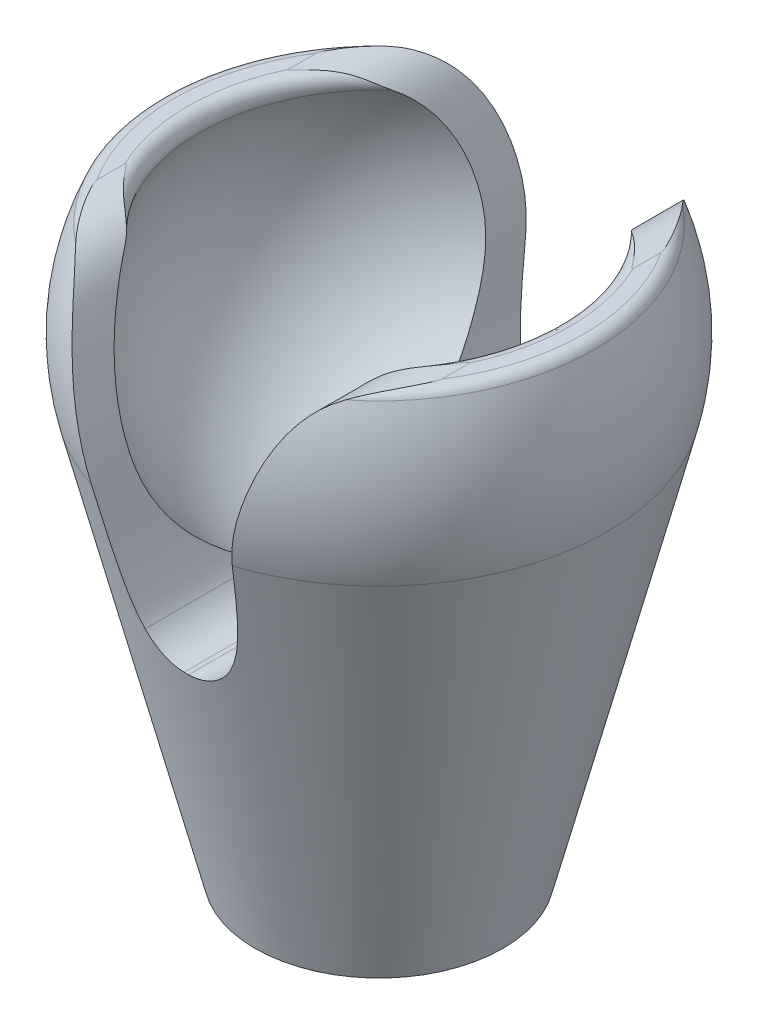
ISO-10303-21;
HEADER;
FILE_DESCRIPTION(('STEP AP214'),'2;1');
FILE_NAME('part.step','',(''),(''),'','','');
FILE_SCHEMA(('AUTOMOTIVE_DESIGN { 1 0 10303 214 1 1 1 1 }'));
ENDSEC;
DATA;
#1=APPLICATION_CONTEXT('core data for automotive mechanical design processes');
#2=APPLICATION_PROTOCOL_DEFINITION('international standard','automotive_design',2000,#1);
#3=PRODUCT_CONTEXT('',#1,'mechanical');
#4=PRODUCT('Part','Part','',(#3));
#5=PRODUCT_RELATED_PRODUCT_CATEGORY('part','',(#4));
#6=PRODUCT_DEFINITION_FORMATION('','',#4);
#7=PRODUCT_DEFINITION_CONTEXT('part definition',#1,'design');
#8=PRODUCT_DEFINITION('design','',#6,#7);
#9=PRODUCT_DEFINITION_SHAPE('','',#8);
#10=(LENGTH_UNIT() NAMED_UNIT(*) SI_UNIT(.MILLI.,.METRE.));
#11=(NAMED_UNIT(*) PLANE_ANGLE_UNIT() SI_UNIT($,.RADIAN.));
#12=(NAMED_UNIT(*) SI_UNIT($,.STERADIAN.) SOLID_ANGLE_UNIT());
#13=UNCERTAINTY_MEASURE_WITH_UNIT(LENGTH_MEASURE(1.E-05),#10,'distance_accuracy_value','');
#14=(GEOMETRIC_REPRESENTATION_CONTEXT(3) GLOBAL_UNCERTAINTY_ASSIGNED_CONTEXT((#13)) GLOBAL_UNIT_ASSIGNED_CONTEXT((#10,
#11,#12)) REPRESENTATION_CONTEXT('',''));
#15=CARTESIAN_POINT('',(0.,0.,0.));
#16=DIRECTION('',(0.,0.,1.));
#17=DIRECTION('',(1.,0.,0.));
#18=AXIS2_PLACEMENT_3D('',#15,#16,#17);
#19=CARTESIAN_POINT('',(0.,0.,0.));
#20=DIRECTION('',(0.,1.,0.));
#21=DIRECTION('',(1.,0.,0.));
#22=AXIS2_PLACEMENT_3D('',#19,#20,#21);
#23=SPHERICAL_SURFACE('',#22,8.);
#24=CARTESIAN_POINT('',(-0.089717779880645,-7.99949690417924,0.));
#25=CARTESIAN_POINT('',(-0.0926989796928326,-7.99946347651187,0.00516391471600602));
#26=CARTESIAN_POINT('',(-0.0956801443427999,-7.99942337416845,0.0103278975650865));
#27=CARTESIAN_POINT('',(-0.209170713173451,-7.99764260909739,0.206923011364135));
#28=CARTESIAN_POINT('',(-0.319596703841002,-7.98673765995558,0.398440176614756));
#29=CARTESIAN_POINT('',(-0.537756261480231,-7.94666509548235,0.781230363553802));
#30=CARTESIAN_POINT('',(-0.645487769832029,-7.91748393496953,0.972503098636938));
#31=CARTESIAN_POINT('',(-0.855858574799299,-7.84100877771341,1.35469837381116));
#32=CARTESIAN_POINT('',(-0.958488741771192,-7.79368354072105,1.5456197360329));
#33=CARTESIAN_POINT('',(-1.15578529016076,-7.68130610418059,1.92634524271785));
#34=CARTESIAN_POINT('',(-1.25045319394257,-7.61625730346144,2.11614959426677));
#35=CARTESIAN_POINT('',(-1.41085823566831,-7.48398197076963,2.4557447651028));
#36=CARTESIAN_POINT('',(-1.47856526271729,-7.41988378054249,2.60582933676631));
#37=CARTESIAN_POINT('',(-1.60557727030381,-7.28122412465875,2.90465986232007));
#38=CARTESIAN_POINT('',(-1.66488546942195,-7.20666668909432,3.05340630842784));
#39=CARTESIAN_POINT('',(-1.77353863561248,-7.04748268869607,3.34944190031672));
#40=CARTESIAN_POINT('',(-1.82287122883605,-6.96284382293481,3.49672902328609));
#41=CARTESIAN_POINT('',(-1.9096462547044,-6.78420640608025,3.78934834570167));
#42=CARTESIAN_POINT('',(-1.94707459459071,-6.69019693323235,3.9346780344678));
#43=CARTESIAN_POINT('',(-1.97757165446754,-6.59192128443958,4.0786988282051));
#44=B_SPLINE_CURVE_WITH_KNOTS('',3,(#24,#25,#26,#27,#28,#29,#30,#31,#32,#33,#34,#35,#36,#37,#38,
#39,#40,#41,#42,#43),.UNSPECIFIED.,.F.,.F.,(4,2,2,2,2,2,2,2,2,4),(0.,0.0178885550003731,
0.681016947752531,1.34463739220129,2.00940561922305,2.67404645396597,3.203633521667,
3.73301708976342,4.2630533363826,4.79371474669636),.UNSPECIFIED.);
#45=CARTESIAN_POINT('',(-1.63435951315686,-7.24231649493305,2.9795504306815));
#46=VERTEX_POINT('',#45);
#47=CARTESIAN_POINT('',(-0.0897177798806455,-7.99949690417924,0.));
#48=VERTEX_POINT('',#47);
#49=EDGE_CURVE('E462',#46,#48,#44,.F.);
#50=ORIENTED_EDGE('',*,*,#49,.T.);
#51=CARTESIAN_POINT('',(-0.089717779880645,-7.99949690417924,0.));
#52=CARTESIAN_POINT('',(-0.0926989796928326,-7.99946347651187,-0.00516391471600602));
#53=CARTESIAN_POINT('',(-0.0956801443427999,-7.99942337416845,-0.0103278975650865));
#54=CARTESIAN_POINT('',(-0.209170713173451,-7.99764260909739,-0.206923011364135));
#55=CARTESIAN_POINT('',(-0.319596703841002,-7.98673765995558,-0.398440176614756));
#56=CARTESIAN_POINT('',(-0.537756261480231,-7.94666509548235,-0.781230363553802));
#57=CARTESIAN_POINT('',(-0.645487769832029,-7.91748393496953,-0.972503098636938));
#58=CARTESIAN_POINT('',(-0.855858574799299,-7.84100877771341,-1.35469837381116));
#59=CARTESIAN_POINT('',(-0.958488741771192,-7.79368354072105,-1.5456197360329));
#60=CARTESIAN_POINT('',(-1.15578529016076,-7.68130610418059,-1.92634524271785));
#61=CARTESIAN_POINT('',(-1.25045319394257,-7.61625730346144,-2.11614959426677));
#62=CARTESIAN_POINT('',(-1.41085823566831,-7.48398197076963,-2.4557447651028));
#63=CARTESIAN_POINT('',(-1.47856526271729,-7.41988378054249,-2.60582933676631));
#64=CARTESIAN_POINT('',(-1.60557727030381,-7.28122412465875,-2.90465986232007));
#65=CARTESIAN_POINT('',(-1.66488546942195,-7.20666668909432,-3.05340630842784));
#66=CARTESIAN_POINT('',(-1.77353863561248,-7.04748268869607,-3.34944190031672));
#67=CARTESIAN_POINT('',(-1.82287122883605,-6.96284382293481,-3.49672902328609));
#68=CARTESIAN_POINT('',(-1.9096462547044,-6.78420640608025,-3.78934834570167));
#69=CARTESIAN_POINT('',(-1.94707459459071,-6.69019693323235,-3.9346780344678));
#70=CARTESIAN_POINT('',(-1.97757165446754,-6.59192128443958,-4.0786988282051));
#71=B_SPLINE_CURVE_WITH_KNOTS('',3,(#51,#52,#53,#54,#55,#56,#57,#58,#59,#60,#61,#62,#63,#64,#65,
#66,#67,#68,#69,#70),.UNSPECIFIED.,.F.,.F.,(4,2,2,2,2,2,2,2,2,4),(0.,0.0178885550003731,
0.681016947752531,1.34463739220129,2.00940561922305,2.67404645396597,3.203633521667,
3.73301708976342,4.2630533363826,4.79371474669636),.UNSPECIFIED.);
#72=CARTESIAN_POINT('',(-1.63435951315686,-7.24231649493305,-2.9795504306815));
#73=VERTEX_POINT('',#72);
#74=EDGE_CURVE('E230',#48,#73,#71,.T.);
#75=ORIENTED_EDGE('',*,*,#74,.T.);
#76=CARTESIAN_POINT('',(-1.63435951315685,-7.24231649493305,-2.9795504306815));
#77=CARTESIAN_POINT('',(-1.67035743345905,-7.19691405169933,-3.07016285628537));
#78=CARTESIAN_POINT('',(-1.70511332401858,-7.14959572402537,-3.1602897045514));
#79=CARTESIAN_POINT('',(-1.7722770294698,-7.05119471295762,-3.33934930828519));
#80=CARTESIAN_POINT('',(-1.80468496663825,-7.00011222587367,-3.42828212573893));
#81=CARTESIAN_POINT('',(-1.89856361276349,-6.8413673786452,-3.69287734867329));
#82=CARTESIAN_POINT('',(-1.95672636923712,-6.72816019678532,-3.86643137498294));
#83=CARTESIAN_POINT('',(-2.06487457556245,-6.48796170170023,-4.20579557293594));
#84=CARTESIAN_POINT('',(-2.11487605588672,-6.36099824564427,-4.37162045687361));
#85=CARTESIAN_POINT('',(-2.20760458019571,-6.09382443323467,-4.69444556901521));
#86=CARTESIAN_POINT('',(-2.25033108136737,-5.9536130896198,-4.85144513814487));
#87=CARTESIAN_POINT('',(-2.31667784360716,-5.70791175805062,-5.10626614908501));
#88=CARTESIAN_POINT('',(-2.34202371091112,-5.60575633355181,-5.20688182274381));
#89=CARTESIAN_POINT('',(-2.39015514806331,-5.39599018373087,-5.40292763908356));
#90=CARTESIAN_POINT('',(-2.41294073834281,-5.28837950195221,-5.49835782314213));
#91=CARTESIAN_POINT('',(-2.44559531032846,-5.12309151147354,-5.63722425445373));
#92=CARTESIAN_POINT('',(-2.4562266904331,-5.06734731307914,-5.68280208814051));
#93=CARTESIAN_POINT('',(-2.47707400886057,-4.95459504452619,-5.77246812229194));
#94=CARTESIAN_POINT('',(-2.48728994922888,-4.8975869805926,-5.81655633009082));
#95=CARTESIAN_POINT('',(-2.50745368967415,-4.78226420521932,-5.90321401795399));
#96=CARTESIAN_POINT('',(-2.51740112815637,-4.723947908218,-5.94578147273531));
#97=CARTESIAN_POINT('',(-2.53711217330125,-4.60611781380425,-6.02926628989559));
#98=CARTESIAN_POINT('',(-2.54687577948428,-4.54660401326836,-6.07018364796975));
#99=CARTESIAN_POINT('',(-2.57580312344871,-4.36634225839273,-6.19043839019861));
#100=CARTESIAN_POINT('',(-2.59460561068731,-4.24386125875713,-6.26728797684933));
#101=CARTESIAN_POINT('',(-2.63105675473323,-3.99471827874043,-6.41412598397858));
#102=CARTESIAN_POINT('',(-2.64870551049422,-3.86805665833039,-6.48411499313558));
#103=CARTESIAN_POINT('',(-2.68769544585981,-3.57464529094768,-6.63574380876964));
#104=CARTESIAN_POINT('',(-2.70867478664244,-3.40666134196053,-6.71510509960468));
#105=CARTESIAN_POINT('',(-2.74996497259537,-3.06522753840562,-6.86126799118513));
#106=CARTESIAN_POINT('',(-2.77027578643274,-2.89177742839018,-6.92806900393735));
#107=CARTESIAN_POINT('',(-2.81307342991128,-2.54084783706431,-7.04736640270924));
#108=CARTESIAN_POINT('',(-2.83555281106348,-2.36338364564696,-7.09990954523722));
#109=CARTESIAN_POINT('',(-2.87344899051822,-2.09487400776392,-7.16683117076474));
#110=CARTESIAN_POINT('',(-2.88677607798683,-2.00499206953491,-7.18715511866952));
#111=CARTESIAN_POINT('',(-2.91510116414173,-1.82464802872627,-7.22367682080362));
#112=CARTESIAN_POINT('',(-2.93009915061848,-1.73418593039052,-7.23987460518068));
#113=CARTESIAN_POINT('',(-2.96206241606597,-1.55209375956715,-7.26815071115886));
#114=CARTESIAN_POINT('',(-2.97904437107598,-1.46046055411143,-7.28019016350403));
#115=CARTESIAN_POINT('',(-3.0148691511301,-1.27708400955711,-7.2998938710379));
#116=CARTESIAN_POINT('',(-3.03371220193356,-1.18534065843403,-7.30755759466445));
#117=CARTESIAN_POINT('',(-3.09290432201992,-0.910249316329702,-7.32397940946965));
#118=CARTESIAN_POINT('',(-3.13591687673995,-0.727037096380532,-7.32616860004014));
#119=CARTESIAN_POINT('',(-3.22768810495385,-0.361951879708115,-7.31345692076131));
#120=CARTESIAN_POINT('',(-3.27646893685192,-0.180087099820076,-7.29848809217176));
#121=CARTESIAN_POINT('',(-3.3778894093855,0.180430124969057,-7.25209659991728));
#122=CARTESIAN_POINT('',(-3.43052921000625,0.359082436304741,-7.22067325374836));
#123=CARTESIAN_POINT('',(-3.53203480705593,0.691691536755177,-7.14661773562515));
#124=CARTESIAN_POINT('',(-3.58063286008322,0.846114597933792,-7.10570248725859));
#125=CARTESIAN_POINT('',(-3.68083158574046,1.15001692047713,-7.01118785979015));
#126=CARTESIAN_POINT('',(-3.7324314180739,1.29949754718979,-6.95759201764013));
#127=CARTESIAN_POINT('',(-3.8389800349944,1.59110013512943,-6.83799330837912));
#128=CARTESIAN_POINT('',(-3.89390841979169,1.73325865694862,-6.77206169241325));
#129=CARTESIAN_POINT('',(-4.00793357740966,2.00937902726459,-6.62769786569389));
#130=CARTESIAN_POINT('',(-4.0670305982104,2.14334038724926,-6.54926491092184));
#131=CARTESIAN_POINT('',(-4.18143582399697,2.38338322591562,-6.3918359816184));
#132=CARTESIAN_POINT('',(-4.23615053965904,2.49076752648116,-6.31439523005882));
#133=CARTESIAN_POINT('',(-4.34930286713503,2.69650889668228,-6.15084255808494));
#134=CARTESIAN_POINT('',(-4.40773816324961,2.79487149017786,-6.06473601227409));
#135=CARTESIAN_POINT('',(-4.52934583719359,2.98218770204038,-5.88323950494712));
#136=CARTESIAN_POINT('',(-4.5925659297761,3.07101676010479,-5.78775208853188));
#137=CARTESIAN_POINT('',(-4.72341570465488,3.23629248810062,-5.58899334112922));
#138=CARTESIAN_POINT('',(-4.79105388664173,3.31271424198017,-5.48570694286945));
#139=CARTESIAN_POINT('',(-4.86092093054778,3.38193731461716,-5.3790285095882));
#140=B_SPLINE_CURVE_WITH_KNOTS('',3,(#76,#77,#78,#79,#80,#81,#82,#83,#84,#85,#86,#87,#88,#89,
#90,#91,#92,#93,#94,#95,#96,#97,#98,#99,#100,#101,#102,#103,#104,#105,#106,#107,#108,#109,#110,
#111,#112,#113,#114,#115,#116,#117,#118,#119,#120,#121,#122,#123,#124,#125,#126,#127,#128,#129,
#130,#131,#132,#133,#134,#135,#136,#137,#138,#139),.UNSPECIFIED.,.F.,.F.,(4,2,2,2,2,2,2,2,2,2,2,
2,2,2,2,2,2,2,2,2,2,2,2,2,2,2,2,2,2,2,2,4),(0.,0.322606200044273,0.64519558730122,
1.29003828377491,1.93359872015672,2.57720715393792,3.01383837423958,3.45046610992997,
3.6688017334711,3.88713628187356,4.10575151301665,4.32436731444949,4.76155089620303,
5.19869693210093,5.75909040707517,6.31951010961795,6.87806915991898,7.15730677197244,
7.43654234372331,7.71832154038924,8.0001349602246,8.56375278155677,9.12961069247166,
9.69549207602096,10.195918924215,10.6962063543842,11.1936886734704,11.6912006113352,
12.1204186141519,12.5493720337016,12.9833811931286,13.4182514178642),.UNSPECIFIED.);
#141=CARTESIAN_POINT('',(-4.86092093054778,3.38193731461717,-5.3790285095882));
#142=VERTEX_POINT('',#141);
#143=EDGE_CURVE('E386',#73,#142,#140,.T.);
#144=ORIENTED_EDGE('',*,*,#143,.T.);
#145=CARTESIAN_POINT('',(0.,3.38193731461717,0.));
#146=DIRECTION('',(0.,1.,0.));
#147=DIRECTION('',(-1.,0.,0.));
#148=AXIS2_PLACEMENT_3D('',#145,#146,#147);
#149=CIRCLE('',#148,7.25);
#150=CARTESIAN_POINT('',(-4.86092093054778,3.38193731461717,5.3790285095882));
#151=VERTEX_POINT('',#150);
#152=EDGE_CURVE('E265',#142,#151,#149,.T.);
#153=ORIENTED_EDGE('',*,*,#152,.T.);
#154=CARTESIAN_POINT('',(-4.86092093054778,3.38193731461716,5.3790285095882));
#155=CARTESIAN_POINT('',(-4.80780485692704,3.32929506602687,5.46012470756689));
#156=CARTESIAN_POINT('',(-4.75598082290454,3.27251506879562,5.53926281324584));
#157=CARTESIAN_POINT('',(-4.65488392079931,3.15148515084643,5.69318331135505));
#158=CARTESIAN_POINT('',(-4.60560841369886,3.0872431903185,5.76797021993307));
#159=CARTESIAN_POINT('',(-4.46214075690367,2.88540340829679,5.98426772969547));
#160=CARTESIAN_POINT('',(-4.37148335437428,2.73784792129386,6.11898846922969));
#161=CARTESIAN_POINT('',(-4.22793724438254,2.47508617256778,6.32611385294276));
#162=CARTESIAN_POINT('',(-4.17256968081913,2.36560126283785,6.40427580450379));
#163=CARTESIAN_POINT('',(-4.06536025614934,2.1388560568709,6.55127800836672));
#164=CARTESIAN_POINT('',(-4.0135190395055,2.02159434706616,6.62011655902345));
#165=CARTESIAN_POINT('',(-3.91285709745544,1.78017180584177,6.74847109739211));
#166=CARTESIAN_POINT('',(-3.86404965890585,1.65598460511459,6.80794761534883));
#167=CARTESIAN_POINT('',(-3.76931849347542,1.40234605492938,6.9171499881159));
#168=CARTESIAN_POINT('',(-3.72339464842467,1.27289492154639,6.96687624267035));
#169=CARTESIAN_POINT('',(-3.64853557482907,1.05262308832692,7.04200861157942));
#170=CARTESIAN_POINT('',(-3.61892951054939,0.962919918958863,7.07006658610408));
#171=CARTESIAN_POINT('',(-3.560683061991,0.781941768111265,7.12178392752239));
#172=CARTESIAN_POINT('',(-3.53204269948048,0.690666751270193,7.1454431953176));
#173=CARTESIAN_POINT('',(-3.47546601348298,0.506892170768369,7.18845628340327));
#174=CARTESIAN_POINT('',(-3.44752971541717,0.414392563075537,7.20780994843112));
#175=CARTESIAN_POINT('',(-3.39250504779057,0.228565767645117,7.24212185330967));
#176=CARTESIAN_POINT('',(-3.36541489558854,0.135240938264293,7.25708998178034));
#177=CARTESIAN_POINT('',(-3.31226594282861,-0.0523021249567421,7.28256956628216));
#178=CARTESIAN_POINT('',(-3.28620707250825,-0.146520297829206,7.29308132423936));
#179=CARTESIAN_POINT('',(-3.23534180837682,-0.33570816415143,7.30955049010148));
#180=CARTESIAN_POINT('',(-3.21053563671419,-0.430677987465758,7.3155070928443));
#181=CARTESIAN_POINT('',(-3.1580523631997,-0.638497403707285,7.32342283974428));
#182=CARTESIAN_POINT('',(-3.13067297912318,-0.751459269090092,7.32445859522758));
#183=CARTESIAN_POINT('',(-3.07839551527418,-0.977835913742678,7.31989207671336));
#184=CARTESIAN_POINT('',(-3.05349768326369,-1.09125073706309,7.3142891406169));
#185=CARTESIAN_POINT('',(-3.00648802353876,-1.31809537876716,7.29637903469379));
#186=CARTESIAN_POINT('',(-2.98437536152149,-1.43152518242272,7.28407387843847));
#187=CARTESIAN_POINT('',(-2.94298427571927,-1.65819759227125,7.25277656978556));
#188=CARTESIAN_POINT('',(-2.92371118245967,-1.77143946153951,7.23377206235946));
#189=CARTESIAN_POINT('',(-2.88782470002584,-1.99708582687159,7.1892743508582));
#190=CARTESIAN_POINT('',(-2.87121188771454,-2.10949013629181,7.16377974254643));
#191=CARTESIAN_POINT('',(-2.84007838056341,-2.33303816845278,7.10664792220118));
#192=CARTESIAN_POINT('',(-2.82555821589,-2.44418156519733,7.07500915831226));
#193=CARTESIAN_POINT('',(-2.7947065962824,-2.68947466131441,6.99832988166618));
#194=CARTESIAN_POINT('',(-2.77869432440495,-2.8232218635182,6.95187430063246));
#195=CARTESIAN_POINT('',(-2.7471145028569,-3.08781702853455,6.85120709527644));
#196=CARTESIAN_POINT('',(-2.73154700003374,-3.21866468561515,6.79699465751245));
#197=CARTESIAN_POINT('',(-2.69982628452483,-3.47709282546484,6.68139603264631));
#198=CARTESIAN_POINT('',(-2.6836730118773,-3.60467297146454,6.62000910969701));
#199=CARTESIAN_POINT('',(-2.65029381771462,-3.85633339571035,6.49037539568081));
#200=CARTESIAN_POINT('',(-2.63306671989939,-3.98040961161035,6.42212102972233));
#201=CARTESIAN_POINT('',(-2.59750509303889,-4.22454227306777,6.27905541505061));
#202=CARTESIAN_POINT('',(-2.5791707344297,-4.34459933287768,6.20424517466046));
#203=CARTESIAN_POINT('',(-2.5509654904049,-4.52138821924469,6.08725778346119));
#204=CARTESIAN_POINT('',(-2.54144646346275,-4.57976836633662,6.04746667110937));
#205=CARTESIAN_POINT('',(-2.52222713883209,-4.69539140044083,5.96630130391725));
#206=CARTESIAN_POINT('',(-2.51252683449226,-4.75263424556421,5.92492699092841));
#207=CARTESIAN_POINT('',(-2.48788006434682,-4.89477895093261,5.81920620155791));
#208=CARTESIAN_POINT('',(-2.47277606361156,-4.97893138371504,5.75388452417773));
#209=CARTESIAN_POINT('',(-2.44158770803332,-5.14445612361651,5.6200353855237));
#210=CARTESIAN_POINT('',(-2.4255032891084,-5.22582824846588,5.55150771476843));
#211=CARTESIAN_POINT('',(-2.37538682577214,-5.46563003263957,5.34141304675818));
#212=CARTESIAN_POINT('',(-2.33948922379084,-5.61975926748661,5.19532381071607));
#213=CARTESIAN_POINT('',(-2.26141391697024,-5.91537209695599,4.89290867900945));
#214=CARTESIAN_POINT('',(-2.2192459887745,-6.05687483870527,4.73659892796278));
#215=CARTESIAN_POINT('',(-2.12770249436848,-6.32665152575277,4.41503008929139));
#216=CARTESIAN_POINT('',(-2.07832941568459,-6.45493001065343,4.24977410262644));
#217=CARTESIAN_POINT('',(-1.96917067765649,-6.70306479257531,3.90405989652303));
#218=CARTESIAN_POINT('',(-1.90901415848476,-6.82227467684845,3.72325211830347));
#219=CARTESIAN_POINT('',(-1.81161314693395,-6.98898307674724,3.44742981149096));
#220=CARTESIAN_POINT('',(-1.77796176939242,-7.04252205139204,3.35474611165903));
#221=CARTESIAN_POINT('',(-1.70811047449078,-7.14550782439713,3.16806835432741));
#222=CARTESIAN_POINT('',(-1.67191042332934,-7.19495440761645,3.07407422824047));
#223=CARTESIAN_POINT('',(-1.63435951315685,-7.24231649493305,2.9795504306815));
#224=B_SPLINE_CURVE_WITH_KNOTS('',3,(#154,#155,#156,#157,#158,#159,#160,#161,#162,#163,#164,
#165,#166,#167,#168,#169,#170,#171,#172,#173,#174,#175,#176,#177,#178,#179,#180,#181,#182,#183,
#184,#185,#186,#187,#188,#189,#190,#191,#192,#193,#194,#195,#196,#197,#198,#199,#200,#201,#202,
#203,#204,#205,#206,#207,#208,#209,#210,#211,#212,#213,#214,#215,#216,#217,#218,#219,#220,#221,
#222,#223),.UNSPECIFIED.,.F.,.F.,(4,2,2,2,2,2,2,2,2,2,2,2,2,2,2,2,2,2,2,2,2,2,2,2,2,2,2,2,2,2,2,
2,2,2,4),(0.,0.330688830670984,0.661028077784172,1.31655700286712,1.75249430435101,
2.18851106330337,2.62631946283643,3.06410990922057,3.35962668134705,3.65515011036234,
3.95068419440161,4.24554667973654,4.54038918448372,4.83528379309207,5.18377959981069,
5.53231016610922,5.88073607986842,6.22980795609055,6.57895542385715,6.92819119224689,
7.35538341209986,7.78262046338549,8.20990137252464,8.63765885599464,9.06535066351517,
9.27919633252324,9.49304986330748,9.81573620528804,10.1384436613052,10.7838052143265,
11.428170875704,12.0723145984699,12.7456909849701,13.0821984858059,13.4187236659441),.UNSPECIFIED.);
#225=EDGE_CURVE('E461',#151,#46,#224,.T.);
#226=ORIENTED_EDGE('',*,*,#225,.T.);
#227=EDGE_LOOP('',(#50,#75,#144,#153,#226));
#228=FACE_BOUND('',#227,.T.);
#229=ADVANCED_FACE('F32',(#228),#23,.F.);
#230=CARTESIAN_POINT('',(0.,3.59330839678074,0.));
#231=DIRECTION('',(0.,1.,0.));
#232=DIRECTION('',(-1.,0.,0.));
#233=AXIS2_PLACEMENT_3D('',#230,#231,#232);
#234=TOROIDAL_SURFACE('',#233,7.703125,0.5);
#235=CARTESIAN_POINT('',(0.,4.09330839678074,0.));
#236=DIRECTION('',(0.,1.,0.));
#237=DIRECTION('',(-1.,0.,0.));
#238=AXIS2_PLACEMENT_3D('',#235,#236,#237);
#239=CIRCLE('',#238,7.703125);
#240=CARTESIAN_POINT('',(-6.96031741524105,4.09330839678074,-3.30032062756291));
#241=VERTEX_POINT('',#240);
#242=CARTESIAN_POINT('',(-6.96031741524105,4.09330839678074,3.30032062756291));
#243=VERTEX_POINT('',#242);
#244=EDGE_CURVE('E262',#241,#243,#239,.T.);
#245=ORIENTED_EDGE('',*,*,#244,.T.);
#246=CARTESIAN_POINT('',(-6.96031741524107,4.09330839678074,3.30032062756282));
#247=CARTESIAN_POINT('',(-6.96029109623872,4.09330726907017,3.29779914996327));
#248=CARTESIAN_POINT('',(-6.96022645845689,4.09330458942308,3.29524839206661));
#249=CARTESIAN_POINT('',(-6.95979963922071,4.09328676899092,3.2900068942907));
#250=CARTESIAN_POINT('',(-6.95941820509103,4.09327082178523,3.28731795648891));
#251=CARTESIAN_POINT('',(-6.95842062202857,4.09322898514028,3.28340258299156));
#252=CARTESIAN_POINT('',(-6.9580214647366,4.0932122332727,3.28212573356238));
#253=CARTESIAN_POINT('',(-6.95701284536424,4.09316980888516,3.27967450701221));
#254=CARTESIAN_POINT('',(-6.956406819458,4.09314428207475,3.27849882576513));
#255=CARTESIAN_POINT('',(-6.95496198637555,4.09308322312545,3.27645721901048));
#256=CARTESIAN_POINT('',(-6.95415283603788,4.09304896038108,3.27557200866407));
#257=CARTESIAN_POINT('',(-6.95225576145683,4.09296829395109,3.27414031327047));
#258=CARTESIAN_POINT('',(-6.95116598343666,4.09292180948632,3.27359616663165));
#259=CARTESIAN_POINT('',(-6.94898074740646,4.0928281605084,3.2729698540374));
#260=CARTESIAN_POINT('',(-6.9478951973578,4.0927814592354,3.27284950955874));
#261=CARTESIAN_POINT('',(-6.94493711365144,4.09265367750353,3.27287153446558));
#262=CARTESIAN_POINT('',(-6.94307585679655,4.09257269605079,3.27327378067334));
#263=CARTESIAN_POINT('',(-6.93885450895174,4.09238786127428,3.27463709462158));
#264=CARTESIAN_POINT('',(-6.93655364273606,4.09228616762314,3.27574642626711));
#265=CARTESIAN_POINT('',(-6.93210410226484,4.09208798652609,3.27825446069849));
#266=CARTESIAN_POINT('',(-6.92995661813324,4.09199154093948,3.27965515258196));
#267=CARTESIAN_POINT('',(-6.92335971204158,4.09169310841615,3.28431555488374));
#268=CARTESIAN_POINT('',(-6.91911312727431,4.09149773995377,3.28785554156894));
#269=CARTESIAN_POINT('',(-6.91087028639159,4.0911131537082,3.29521910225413));
#270=CARTESIAN_POINT('',(-6.90687474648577,4.09092395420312,3.29904342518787));
#271=CARTESIAN_POINT('',(-6.89904188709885,4.09054801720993,3.30685818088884));
#272=CARTESIAN_POINT('',(-6.89520469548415,4.09036128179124,3.3108487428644));
#273=CARTESIAN_POINT('',(-6.88764490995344,4.08998858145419,3.31892457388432));
#274=CARTESIAN_POINT('',(-6.8839221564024,4.08980261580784,3.32300969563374));
#275=CARTESIAN_POINT('',(-6.86565232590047,4.08887862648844,3.34340414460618));
#276=CARTESIAN_POINT('',(-6.85162073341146,4.08813284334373,3.36017081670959));
#277=CARTESIAN_POINT('',(-6.82388696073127,4.08659068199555,3.39398703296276));
#278=CARTESIAN_POINT('',(-6.81018512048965,4.08579425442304,3.41103684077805));
#279=CARTESIAN_POINT('',(-6.78293663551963,4.08414016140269,3.44519905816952));
#280=CARTESIAN_POINT('',(-6.76938972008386,4.08328263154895,3.46231125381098));
#281=CARTESIAN_POINT('',(-6.74230656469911,4.08149518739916,3.49652995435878));
#282=CARTESIAN_POINT('',(-6.72877032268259,4.08056529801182,3.51363645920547));
#283=CARTESIAN_POINT('',(-6.68792743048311,4.07764392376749,3.56506151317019));
#284=CARTESIAN_POINT('',(-6.66053015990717,4.07552935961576,3.59930216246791));
#285=CARTESIAN_POINT('',(-6.60523758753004,4.07090804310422,3.66735186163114));
#286=CARTESIAN_POINT('',(-6.57734228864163,4.06840129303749,3.70116091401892));
#287=CARTESIAN_POINT('',(-6.49273129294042,4.06019223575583,3.80176732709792));
#288=CARTESIAN_POINT('',(-6.43509163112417,4.05380119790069,3.86774248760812));
#289=CARTESIAN_POINT('',(-6.31713980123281,4.03854464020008,3.99690552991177));
#290=CARTESIAN_POINT('',(-6.25682910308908,4.02968046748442,4.0600949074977));
#291=CARTESIAN_POINT('',(-6.1337199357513,4.00866540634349,4.18345911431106));
#292=CARTESIAN_POINT('',(-6.07092131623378,3.99651431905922,4.24363376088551));
#293=CARTESIAN_POINT('',(-5.96438639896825,3.97265288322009,4.34167182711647));
#294=CARTESIAN_POINT('',(-5.9211589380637,3.96210698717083,4.38037550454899));
#295=CARTESIAN_POINT('',(-5.834166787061,3.93878929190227,4.45649086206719));
#296=CARTESIAN_POINT('',(-5.79040210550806,3.92601752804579,4.49390256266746));
#297=CARTESIAN_POINT('',(-5.70273709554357,3.89796036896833,4.56761050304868));
#298=CARTESIAN_POINT('',(-5.65883676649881,3.88267496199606,4.60390673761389));
#299=CARTESIAN_POINT('',(-5.5714519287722,3.84938526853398,4.67565264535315));
#300=CARTESIAN_POINT('',(-5.52796705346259,3.83138367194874,4.71110311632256));
#301=CARTESIAN_POINT('',(-5.4419687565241,3.7925617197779,4.78163383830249));
#302=CARTESIAN_POINT('',(-5.39945527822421,3.77174152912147,4.81671411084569));
#303=CARTESIAN_POINT('',(-5.31605333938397,3.72738868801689,4.88707610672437));
#304=CARTESIAN_POINT('',(-5.27516445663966,3.70385674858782,4.92235777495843));
#305=CARTESIAN_POINT('',(-5.21152886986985,3.6643092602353,4.97952950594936));
#306=CARTESIAN_POINT('',(-5.18805941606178,3.64904597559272,5.00113939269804));
#307=CARTESIAN_POINT('',(-5.14206407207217,3.61779711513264,5.04482846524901));
#308=CARTESIAN_POINT('',(-5.11953801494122,3.60181166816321,5.06690756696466));
#309=CARTESIAN_POINT('',(-5.07554858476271,3.56927432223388,5.11168385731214));
#310=CARTESIAN_POINT('',(-5.05408491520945,3.55272258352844,5.13438087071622));
#311=CARTESIAN_POINT('',(-5.01218073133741,3.51912542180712,5.18069377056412));
#312=CARTESIAN_POINT('',(-4.99174771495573,3.50207750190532,5.20431464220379));
#313=CARTESIAN_POINT('',(-4.95213796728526,3.46779886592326,5.252483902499));
#314=CARTESIAN_POINT('',(-4.93296173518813,3.45056808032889,5.27703265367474));
#315=CARTESIAN_POINT('',(-4.8959253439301,3.41615123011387,5.32720299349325));
#316=CARTESIAN_POINT('',(-4.87806710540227,3.39896526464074,5.35282606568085));
#317=CARTESIAN_POINT('',(-4.86092093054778,3.38193731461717,5.3790285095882));
#318=B_SPLINE_CURVE_WITH_KNOTS('',3,(#246,#247,#248,#249,#250,#251,#252,#253,#254,#255,#256,
#257,#258,#259,#260,#261,#262,#263,#264,#265,#266,#267,#268,#269,#270,#271,#272,#273,#274,#275,
#276,#277,#278,#279,#280,#281,#282,#283,#284,#285,#286,#287,#288,#289,#290,#291,#292,#293,#294,
#295,#296,#297,#298,#299,#300,#301,#302,#303,#304,#305,#306,#307,#308,#309,#310,#311,#312,#313,
#314,#315,#316,#317),.UNSPECIFIED.,.F.,.F.,(4,2,2,2,2,2,2,2,2,2,2,2,2,2,2,2,2,2,2,2,2,2,2,2,2,2,
2,2,2,2,2,2,2,2,2,4),(0.,0.00761552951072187,0.0157309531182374,0.0197325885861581,
0.0236707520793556,0.0272115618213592,0.0307763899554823,0.0340104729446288,0.0396346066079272,
0.0472671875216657,0.0549536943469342,0.071508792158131,0.0881091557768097,0.104722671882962,
0.121311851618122,0.186913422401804,0.252579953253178,0.318105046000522,0.383607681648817,
0.515312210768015,0.647015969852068,0.910429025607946,1.17369887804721,1.43698466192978,
1.61385146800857,1.79071546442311,1.96758028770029,2.14427109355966,2.32095156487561,
2.49758581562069,2.60366471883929,2.7097247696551,2.81575505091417,2.92246968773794,
3.02922645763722,3.13613584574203),.UNSPECIFIED.);
#319=EDGE_CURVE('E391',#243,#151,#318,.T.);
#320=ORIENTED_EDGE('',*,*,#319,.T.);
#321=ORIENTED_EDGE('',*,*,#152,.F.);
#322=CARTESIAN_POINT('',(-4.86092093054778,3.38193731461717,-5.3790285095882));
#323=CARTESIAN_POINT('',(-4.88349210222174,3.4043629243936,-5.3445260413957));
#324=CARTESIAN_POINT('',(-4.90730177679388,3.42705166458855,-5.31103566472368));
#325=CARTESIAN_POINT('',(-4.95714667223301,3.47235615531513,-5.24587678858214));
#326=CARTESIAN_POINT('',(-4.98317596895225,3.49497194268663,-5.21420379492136));
#327=CARTESIAN_POINT('',(-5.03730963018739,3.539638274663,-5.15232207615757));
#328=CARTESIAN_POINT('',(-5.06541261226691,3.56168918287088,-5.12211239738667));
#329=CARTESIAN_POINT('',(-5.12324983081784,3.60463551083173,-5.06303016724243));
#330=CARTESIAN_POINT('',(-5.15296962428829,3.62553860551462,-5.03414902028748));
#331=CARTESIAN_POINT('',(-5.21398447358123,3.66603765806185,-4.9771185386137));
#332=CARTESIAN_POINT('',(-5.24528011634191,3.68563312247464,-4.94896948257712));
#333=CARTESIAN_POINT('',(-5.30914017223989,3.72327136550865,-4.89306963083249));
#334=CARTESIAN_POINT('',(-5.34170477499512,3.74131391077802,-4.86531889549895));
#335=CARTESIAN_POINT('',(-5.43319662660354,3.78891121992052,-4.78857141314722));
#336=CARTESIAN_POINT('',(-5.4931392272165,3.81664916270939,-4.73964726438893));
#337=CARTESIAN_POINT('',(-5.61426417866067,3.86666356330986,-4.64057098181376));
#338=CARTESIAN_POINT('',(-5.67544665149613,3.8889394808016,-4.59041872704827));
#339=CARTESIAN_POINT('',(-5.79762767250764,3.92857356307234,-4.4879438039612));
#340=CARTESIAN_POINT('',(-5.85862613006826,3.94592960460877,-4.43562020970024));
#341=CARTESIAN_POINT('',(-5.97934859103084,3.97650376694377,-4.32838750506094));
#342=CARTESIAN_POINT('',(-6.03907274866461,3.98972239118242,-4.27347871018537));
#343=CARTESIAN_POINT('',(-6.15960997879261,4.01345097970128,-4.15806391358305));
#344=CARTESIAN_POINT('',(-6.22032075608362,4.02378641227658,-4.09741528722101));
#345=CARTESIAN_POINT('',(-6.30939506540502,4.03717281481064,-4.00441799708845));
#346=CARTESIAN_POINT('',(-6.33871648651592,4.04127805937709,-3.97312487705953));
#347=CARTESIAN_POINT('',(-6.39671391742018,4.04888023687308,-3.90988152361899));
#348=CARTESIAN_POINT('',(-6.42539002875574,4.05237726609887,-3.8779313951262));
#349=CARTESIAN_POINT('',(-6.47911572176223,4.05850464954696,-3.81682543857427));
#350=CARTESIAN_POINT('',(-6.50422872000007,4.06118751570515,-3.78773044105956));
#351=CARTESIAN_POINT('',(-6.55399327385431,4.06618706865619,-3.72908211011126));
#352=CARTESIAN_POINT('',(-6.57864448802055,4.06850349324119,-3.69952846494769));
#353=CARTESIAN_POINT('',(-6.62787397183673,4.07284635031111,-3.63963264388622));
#354=CARTESIAN_POINT('',(-6.65244625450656,4.07486820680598,-3.60928522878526));
#355=CARTESIAN_POINT('',(-6.70120766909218,4.07862287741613,-3.54841247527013));
#356=CARTESIAN_POINT('',(-6.72539770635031,4.0803565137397,-3.51788790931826));
#357=CARTESIAN_POINT('',(-6.75927822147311,4.08262075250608,-3.47508841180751));
#358=CARTESIAN_POINT('',(-6.76897996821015,4.0832502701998,-3.46282730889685));
#359=CARTESIAN_POINT('',(-6.78844725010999,4.08447663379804,-3.43829196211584));
#360=CARTESIAN_POINT('',(-6.79821288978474,4.0850733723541,-3.42601779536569));
#361=CARTESIAN_POINT('',(-6.81792839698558,4.08624167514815,-3.40142469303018));
#362=CARTESIAN_POINT('',(-6.82787913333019,4.08681294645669,-3.38910643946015));
#363=CARTESIAN_POINT('',(-6.84769333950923,4.08791418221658,-3.3649725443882));
#364=CARTESIAN_POINT('',(-6.85755136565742,4.08844485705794,-3.35315252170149));
#365=CARTESIAN_POINT('',(-6.87259449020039,4.0892277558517,-3.3357306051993));
#366=CARTESIAN_POINT('',(-6.87762847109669,4.08948541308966,-3.32999960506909));
#367=CARTESIAN_POINT('',(-6.88787027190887,4.09000048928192,-3.31865800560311));
#368=CARTESIAN_POINT('',(-6.89307865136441,4.09025790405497,-3.31304791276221));
#369=CARTESIAN_POINT('',(-6.90366232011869,4.09077131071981,-3.30215470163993));
#370=CARTESIAN_POINT('',(-6.90903348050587,4.09102725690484,-3.29686773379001));
#371=CARTESIAN_POINT('',(-6.91743481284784,4.09141952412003,-3.2893511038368));
#372=CARTESIAN_POINT('',(-6.92028447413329,4.09155130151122,-3.28692058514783));
#373=CARTESIAN_POINT('',(-6.92616409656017,4.09182028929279,-3.28229144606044));
#374=CARTESIAN_POINT('',(-6.92919356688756,4.09195748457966,-3.28009223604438));
#375=CARTESIAN_POINT('',(-6.93353616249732,4.09215180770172,-3.27743886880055));
#376=CARTESIAN_POINT('',(-6.93471187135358,4.09220420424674,-3.2767662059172));
#377=CARTESIAN_POINT('',(-6.93711434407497,4.09231079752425,-3.2755231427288));
#378=CARTESIAN_POINT('',(-6.93834112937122,4.09236499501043,-3.27495278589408));
#379=CARTESIAN_POINT('',(-6.94160934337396,4.09250869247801,-3.27366562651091));
#380=CARTESIAN_POINT('',(-6.94370640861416,4.0926002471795,-3.27305925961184));
#381=CARTESIAN_POINT('',(-6.94708162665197,4.0927463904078,-3.27280709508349));
#382=CARTESIAN_POINT('',(-6.9483248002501,4.0927999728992,-3.27286065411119));
#383=CARTESIAN_POINT('',(-6.95073156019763,4.09290324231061,-3.27342154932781));
#384=CARTESIAN_POINT('',(-6.95189440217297,4.09295289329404,-3.27393263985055));
#385=CARTESIAN_POINT('',(-6.95380321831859,4.0930341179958,-3.27526527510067));
#386=CARTESIAN_POINT('',(-6.9545829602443,4.09306716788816,-3.27604061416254));
#387=CARTESIAN_POINT('',(-6.95636152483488,4.09314240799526,-3.27830891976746));
#388=CARTESIAN_POINT('',(-6.95717108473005,4.09317648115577,-3.27993994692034));
#389=CARTESIAN_POINT('',(-6.95861547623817,4.09323718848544,-3.2838014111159));
#390=CARTESIAN_POINT('',(-6.95913053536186,4.09325875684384,-3.28606795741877));
#391=CARTESIAN_POINT('',(-6.95986228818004,4.0932893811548,-3.29065323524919));
#392=CARTESIAN_POINT('',(-6.96007737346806,4.0932983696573,-3.29297218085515));
#393=CARTESIAN_POINT('',(-6.96027961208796,4.09330681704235,-3.29697025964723));
#394=CARTESIAN_POINT('',(-6.96031368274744,4.09330823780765,-3.29864698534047));
#395=CARTESIAN_POINT('',(-6.96031741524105,4.09330839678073,-3.30032062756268));
#396=B_SPLINE_CURVE_WITH_KNOTS('',3,(#322,#323,#324,#325,#326,#327,#328,#329,#330,#331,#332,
#333,#334,#335,#336,#337,#338,#339,#340,#341,#342,#343,#344,#345,#346,#347,#348,#349,#350,#351,
#352,#353,#354,#355,#356,#357,#358,#359,#360,#361,#362,#363,#364,#365,#366,#367,#368,#369,#370,
#371,#372,#373,#374,#375,#376,#377,#378,#379,#380,#381,#382,#383,#384,#385,#386,#387,#388,#389,
#390,#391,#392,#393,#394,#395),.UNSPECIFIED.,.F.,.F.,(4,2,2,2,2,2,2,2,2,2,2,2,2,2,2,2,2,2,2,2,2,
2,2,2,2,2,2,2,2,2,2,2,2,2,2,2,4),(0.,0.140742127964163,0.281119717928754,0.421404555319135,
0.560594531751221,0.699836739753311,0.839099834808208,1.08545676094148,1.33183804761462,
1.57832550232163,1.82478295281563,2.08393154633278,2.21315928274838,2.34236654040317,
2.45794189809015,2.5735995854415,2.69089669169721,2.80785321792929,2.85479677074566,
2.9018858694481,2.94942220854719,2.99561888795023,3.01851335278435,3.04149006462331,
3.06409058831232,3.07532987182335,3.08653977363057,3.09060132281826,3.09466459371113,
3.10111201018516,3.1047912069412,3.10850087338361,3.11175180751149,3.11712492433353,
3.12406471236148,3.13104156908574,3.13606756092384),.UNSPECIFIED.);
#397=EDGE_CURVE('E377',#142,#241,#396,.T.);
#398=ORIENTED_EDGE('',*,*,#397,.T.);
#399=EDGE_LOOP('',(#245,#320,#321,#398));
#400=FACE_BOUND('',#399,.T.);
#401=ADVANCED_FACE('F384',(#400),#234,.T.);
#402=CARTESIAN_POINT('',(7.703125,4.09330839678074,0.));
#403=DIRECTION('',(0.,-1.,0.));
#404=DIRECTION('',(1.,0.,0.));
#405=AXIS2_PLACEMENT_3D('',#402,#403,#404);
#406=PLANE('',#405);
#407=CARTESIAN_POINT('',(0.,4.09330839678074,0.));
#408=DIRECTION('',(0.,1.,0.));
#409=DIRECTION('',(-1.,0.,0.));
#410=AXIS2_PLACEMENT_3D('',#407,#408,#409);
#411=CIRCLE('',#410,8.25155347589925);
#412=CARTESIAN_POINT('',(-6.96031741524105,4.09330839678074,-4.43194271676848));
#413=VERTEX_POINT('',#412);
#414=CARTESIAN_POINT('',(-6.96031741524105,4.09330839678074,4.43194271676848));
#415=VERTEX_POINT('',#414);
#416=EDGE_CURVE('E258',#413,#415,#411,.T.);
#417=ORIENTED_EDGE('',*,*,#416,.T.);
#418=DIRECTION('',(0.,0.,1.));
#419=VECTOR('',#418,1.);
#420=CARTESIAN_POINT('',(-6.96031741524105,4.09330839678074,-12.5));
#421=LINE('',#420,#419);
#422=EDGE_CURVE('E289',#243,#415,#421,.T.);
#423=ORIENTED_EDGE('',*,*,#422,.F.);
#424=ORIENTED_EDGE('',*,*,#244,.F.);
#425=EDGE_CURVE('E291',#413,#241,#421,.T.);
#426=ORIENTED_EDGE('',*,*,#425,.F.);
#427=EDGE_LOOP('',(#417,#423,#424,#426));
#428=FACE_BOUND('',#427,.T.);
#429=ADVANCED_FACE('F389',(#428),#406,.F.);
#430=CARTESIAN_POINT('',(0.,3.59330839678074,0.));
#431=DIRECTION('',(0.,1.,0.));
#432=DIRECTION('',(-1.,0.,0.));
#433=AXIS2_PLACEMENT_3D('',#430,#431,#432);
#434=TOROIDAL_SURFACE('',#433,8.25155347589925,0.5);
#435=CARTESIAN_POINT('',(0.,3.79293664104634,0.));
#436=DIRECTION('',(0.,1.,0.));
#437=DIRECTION('',(-1.,0.,0.));
#438=AXIS2_PLACEMENT_3D('',#435,#436,#437);
#439=CIRCLE('',#438,8.70997311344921);
#440=CARTESIAN_POINT('',(-5.44390841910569,3.79293664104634,-6.79908028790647));
#441=VERTEX_POINT('',#440);
#442=CARTESIAN_POINT('',(-5.44390841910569,3.79293664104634,6.79908028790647));
#443=VERTEX_POINT('',#442);
#444=EDGE_CURVE('E254',#441,#443,#439,.T.);
#445=ORIENTED_EDGE('',*,*,#444,.T.);
#446=CARTESIAN_POINT('',(-5.44390841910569,3.79293664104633,6.79908028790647));
#447=CARTESIAN_POINT('',(-5.4713791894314,3.80600838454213,6.76977755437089));
#448=CARTESIAN_POINT('',(-5.49862458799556,3.8182877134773,6.73992662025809));
#449=CARTESIAN_POINT('',(-5.55267615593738,3.84143512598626,6.67931766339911));
#450=CARTESIAN_POINT('',(-5.57948251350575,3.85230382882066,6.6485600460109));
#451=CARTESIAN_POINT('',(-5.63264781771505,3.87279786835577,6.58635222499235));
#452=CARTESIAN_POINT('',(-5.65900742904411,3.88242522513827,6.55490324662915));
#453=CARTESIAN_POINT('',(-5.71134270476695,3.90060147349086,6.49137594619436));
#454=CARTESIAN_POINT('',(-5.73731832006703,3.90915022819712,6.45929754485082));
#455=CARTESIAN_POINT('',(-5.81462170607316,3.93335023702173,6.3623413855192));
#456=CARTESIAN_POINT('',(-5.86539338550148,3.94758055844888,6.29666326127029));
#457=CARTESIAN_POINT('',(-5.96550896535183,3.97305738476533,6.1636296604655));
#458=CARTESIAN_POINT('',(-6.01485214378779,3.98430240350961,6.09627336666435));
#459=CARTESIAN_POINT('',(-6.11206208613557,4.00440408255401,5.96020090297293));
#460=CARTESIAN_POINT('',(-6.15992944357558,4.01326171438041,5.89148529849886));
#461=CARTESIAN_POINT('',(-6.2541524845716,4.02906637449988,5.75282875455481));
#462=CARTESIAN_POINT('',(-6.30050839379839,4.03601368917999,5.68288800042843));
#463=CARTESIAN_POINT('',(-6.391577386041,4.04836490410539,5.54191224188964));
#464=CARTESIAN_POINT('',(-6.43629205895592,4.05377033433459,5.47087839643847));
#465=CARTESIAN_POINT('',(-6.52397652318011,4.06334168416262,5.32766154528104));
#466=CARTESIAN_POINT('',(-6.56694638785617,4.06750765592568,5.25547858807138));
#467=CARTESIAN_POINT('',(-6.63155954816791,4.07314784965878,5.14339357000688));
#468=CARTESIAN_POINT('',(-6.65391840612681,4.07497861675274,5.10392040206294));
#469=CARTESIAN_POINT('',(-6.6979754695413,4.07837682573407,5.02459190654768));
#470=CARTESIAN_POINT('',(-6.71967363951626,4.0799442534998,4.98473655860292));
#471=CARTESIAN_POINT('',(-6.76236975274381,4.08284718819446,4.9044506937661));
#472=CARTESIAN_POINT('',(-6.78336474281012,4.08418179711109,4.86401857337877));
#473=CARTESIAN_POINT('',(-6.82436183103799,4.08663243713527,4.78265093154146));
#474=CARTESIAN_POINT('',(-6.84436411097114,4.08774850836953,4.74171550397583));
#475=CARTESIAN_POINT('',(-6.87148295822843,4.08917268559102,4.68354691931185));
#476=CARTESIAN_POINT('',(-6.87922663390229,4.08956838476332,4.66660811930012));
#477=CARTESIAN_POINT('',(-6.89438634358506,4.09032369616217,4.63257859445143));
#478=CARTESIAN_POINT('',(-6.90180231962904,4.09068330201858,4.61548784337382));
#479=CARTESIAN_POINT('',(-6.91611492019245,4.09136061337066,4.58123524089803));
#480=CARTESIAN_POINT('',(-6.92301490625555,4.09167860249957,4.56407479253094));
#481=CARTESIAN_POINT('',(-6.93611178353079,4.09226859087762,4.52947384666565));
#482=CARTESIAN_POINT('',(-6.94230874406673,4.09254059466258,4.51203337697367));
#483=CARTESIAN_POINT('',(-6.94927880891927,4.09284103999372,4.48927451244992));
#484=CARTESIAN_POINT('',(-6.95076872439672,4.09290486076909,4.48417948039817));
#485=CARTESIAN_POINT('',(-6.95355694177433,4.09302371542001,4.47394384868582));
#486=CARTESIAN_POINT('',(-6.95485549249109,4.09307876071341,4.46880331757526));
#487=CARTESIAN_POINT('',(-6.95717952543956,4.09317688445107,4.45843168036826));
#488=CARTESIAN_POINT('',(-6.95820368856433,4.09321990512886,4.45320026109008));
#489=CARTESIAN_POINT('',(-6.95937336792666,4.09326892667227,4.44528539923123));
#490=CARTESIAN_POINT('',(-6.95970243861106,4.09328269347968,4.44263076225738));
#491=CARTESIAN_POINT('',(-6.96017023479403,4.0933022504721,4.4373004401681));
#492=CARTESIAN_POINT('',(-6.96030859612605,4.09330802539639,4.4346247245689));
#493=CARTESIAN_POINT('',(-6.96031741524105,4.09330839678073,4.43194271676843));
#494=B_SPLINE_CURVE_WITH_KNOTS('',3,(#446,#447,#448,#449,#450,#451,#452,#453,#454,#455,#456,
#457,#458,#459,#460,#461,#462,#463,#464,#465,#466,#467,#468,#469,#470,#471,#472,#473,#474,#475,
#476,#477,#478,#479,#480,#481,#482,#483,#484,#485,#486,#487,#488,#489,#490,#491,#492,#493),
.UNSPECIFIED.,.F.,.F.,(4,2,2,2,2,2,2,2,2,2,2,2,2,2,2,2,2,2,2,2,2,2,2,4),(0.,0.126689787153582,
0.253323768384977,0.379749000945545,0.506190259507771,0.758751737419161,1.01143871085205,
1.26402269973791,1.51656880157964,1.76886342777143,2.02114743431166,2.15734982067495,
2.29355950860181,2.43028348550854,2.56698233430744,2.62286762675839,2.67876276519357,
2.73425455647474,2.78974087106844,2.80566453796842,2.82156731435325,2.83754522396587,
2.84556442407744,2.85359891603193),.UNSPECIFIED.);
#495=EDGE_CURVE('E332',#443,#415,#494,.T.);
#496=ORIENTED_EDGE('',*,*,#495,.T.);
#497=ORIENTED_EDGE('',*,*,#416,.F.);
#498=CARTESIAN_POINT('',(-6.96031741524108,4.09330839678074,-4.4319427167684));
#499=CARTESIAN_POINT('',(-6.96029380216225,4.09330740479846,-4.43557844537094));
#500=CARTESIAN_POINT('',(-6.96004990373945,4.09329722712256,-4.43919907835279));
#501=CARTESIAN_POINT('',(-6.95925373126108,4.0932639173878,-4.4463981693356));
#502=CARTESIAN_POINT('',(-6.95870229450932,4.09324082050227,-4.44997671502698));
#503=CARTESIAN_POINT('',(-6.95678658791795,4.09316034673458,-4.46063179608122));
#504=CARTESIAN_POINT('',(-6.95515860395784,4.09309169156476,-4.46765723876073));
#505=CARTESIAN_POINT('',(-6.9515367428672,4.09293775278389,-4.48156749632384));
#506=CARTESIAN_POINT('',(-6.9495448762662,4.09285256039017,-4.48845286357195));
#507=CARTESIAN_POINT('',(-6.9453165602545,4.09267018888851,-4.50215674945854));
#508=CARTESIAN_POINT('',(-6.94307980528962,4.09257299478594,-4.50897517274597));
#509=CARTESIAN_POINT('',(-6.93613811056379,4.09226862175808,-4.52928377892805));
#510=CARTESIAN_POINT('',(-6.93118427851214,4.09204791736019,-4.54268802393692));
#511=CARTESIAN_POINT('',(-6.92086890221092,4.09157921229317,-4.56936256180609));
#512=CARTESIAN_POINT('',(-6.91550664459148,4.09133116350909,-4.58263257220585));
#513=CARTESIAN_POINT('',(-6.89602214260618,4.09041124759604,-4.6294546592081));
#514=CARTESIAN_POINT('',(-6.88115508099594,4.08967621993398,-4.66269449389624));
#515=CARTESIAN_POINT('',(-6.85047557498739,4.08807328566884,-4.72869719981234));
#516=CARTESIAN_POINT('',(-6.83466369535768,4.08720545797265,-4.76146034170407));
#517=CARTESIAN_POINT('',(-6.80234466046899,4.08533243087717,-4.82663181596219));
#518=CARTESIAN_POINT('',(-6.78583761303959,4.08432725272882,-4.85904020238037));
#519=CARTESIAN_POINT('',(-6.75211501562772,4.08216055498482,-4.92386915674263));
#520=CARTESIAN_POINT('',(-6.73489424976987,4.08099764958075,-4.9562869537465));
#521=CARTESIAN_POINT('',(-6.69997253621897,4.07851048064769,-5.02086107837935));
#522=CARTESIAN_POINT('',(-6.6822715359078,4.0771861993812,-5.0530173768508));
#523=CARTESIAN_POINT('',(-6.64643926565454,4.07436141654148,-5.11709516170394));
#524=CARTESIAN_POINT('',(-6.62830785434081,4.07286085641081,-5.14901656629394));
#525=CARTESIAN_POINT('',(-6.57568111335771,4.0682757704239,-5.2403582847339));
#526=CARTESIAN_POINT('',(-6.54070150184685,4.06495090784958,-5.29948840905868));
#527=CARTESIAN_POINT('',(-6.46953540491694,4.05750271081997,-5.41699341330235));
#528=CARTESIAN_POINT('',(-6.43334850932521,4.05337910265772,-5.47536802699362));
#529=CARTESIAN_POINT('',(-6.35987765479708,4.04418303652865,-5.5913405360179));
#530=CARTESIAN_POINT('',(-6.32259379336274,4.03911066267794,-5.64893849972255));
#531=CARTESIAN_POINT('',(-6.24700883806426,4.02783726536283,-5.76331204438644));
#532=CARTESIAN_POINT('',(-6.20870824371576,4.02163678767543,-5.82008800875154));
#533=CARTESIAN_POINT('',(-6.13114262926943,4.00789029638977,-5.93275212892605));
#534=CARTESIAN_POINT('',(-6.09187834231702,4.00034527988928,-5.98864090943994));
#535=CARTESIAN_POINT('',(-6.01394955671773,3.98396795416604,-6.09729581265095));
#536=CARTESIAN_POINT('',(-5.97532252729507,3.97519818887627,-6.15009813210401));
#537=CARTESIAN_POINT('',(-5.89718347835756,3.95587663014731,-6.25470565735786));
#538=CARTESIAN_POINT('',(-5.85767158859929,3.94532509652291,-6.30651100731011));
#539=CARTESIAN_POINT('',(-5.77772546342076,3.92207458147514,-6.40895888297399));
#540=CARTESIAN_POINT('',(-5.73729081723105,3.9093746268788,-6.45960086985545));
#541=CARTESIAN_POINT('',(-5.6553998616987,3.88135388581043,-6.55949384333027));
#542=CARTESIAN_POINT('',(-5.61394179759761,3.86602828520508,-6.60874207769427));
#543=CARTESIAN_POINT('',(-5.55090218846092,3.84061634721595,-6.68123744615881));
#544=CARTESIAN_POINT('',(-5.52969554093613,3.83171775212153,-6.70522836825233));
#545=CARTESIAN_POINT('',(-5.4870091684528,3.81302321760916,-6.75262111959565));
#546=CARTESIAN_POINT('',(-5.46552937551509,3.80322705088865,-6.77602279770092));
#547=CARTESIAN_POINT('',(-5.44390841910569,3.79293664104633,-6.79908028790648));
#548=B_SPLINE_CURVE_WITH_KNOTS('',3,(#498,#499,#500,#501,#502,#503,#504,#505,#506,#507,#508,
#509,#510,#511,#512,#513,#514,#515,#516,#517,#518,#519,#520,#521,#522,#523,#524,#525,#526,#527,
#528,#529,#530,#531,#532,#533,#534,#535,#536,#537,#538,#539,#540,#541,#542,#543,#544,#545,#546,
#547),.UNSPECIFIED.,.F.,.F.,(4,2,2,2,2,2,2,2,2,2,2,2,2,2,2,2,2,2,2,2,2,2,2,2,4),(0.,
0.0108812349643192,0.0217329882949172,0.0433484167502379,0.064847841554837,0.086374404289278,
0.129238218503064,0.172178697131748,0.281404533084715,0.390565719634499,0.499710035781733,
0.609884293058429,0.720070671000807,0.830293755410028,1.03661850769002,1.24301408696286,
1.44939137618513,1.65566908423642,1.86179445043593,2.0597862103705,2.2577491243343,
2.45580195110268,2.65422187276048,2.75390620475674,2.85361585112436),.UNSPECIFIED.);
#549=EDGE_CURVE('E379',#413,#441,#548,.T.);
#550=ORIENTED_EDGE('',*,*,#549,.T.);
#551=EDGE_LOOP('',(#445,#496,#497,#550));
#552=FACE_BOUND('',#551,.T.);
#553=ADVANCED_FACE('F393',(#552),#434,.T.);
#554=CARTESIAN_POINT('',(0.,0.,0.));
#555=DIRECTION('',(0.,1.,0.));
#556=DIRECTION('',(1.,0.,0.));
#557=AXIS2_PLACEMENT_3D('',#554,#555,#556);
#558=SPHERICAL_SURFACE('',#557,9.5);
#559=CARTESIAN_POINT('',(0.,-2.32609917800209,0.));
#560=DIRECTION('',(0.,1.,0.));
#561=DIRECTION('',(-1.,0.,0.));
#562=AXIS2_PLACEMENT_3D('',#559,#560,#561);
#563=CIRCLE('',#562,9.21082312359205);
#564=CARTESIAN_POINT('',(-2.84131304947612,-2.3260991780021,-8.76163242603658));
#565=VERTEX_POINT('',#564);
#566=CARTESIAN_POINT('',(-2.84131304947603,-2.32609917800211,8.76163242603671));
#567=VERTEX_POINT('',#566);
#568=EDGE_CURVE('E250',#565,#567,#563,.T.);
#569=ORIENTED_EDGE('',*,*,#568,.T.);
#570=CARTESIAN_POINT('',(-2.84131304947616,-2.32609917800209,8.76163242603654));
#571=CARTESIAN_POINT('',(-2.84982010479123,-2.26271584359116,8.77570109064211));
#572=CARTESIAN_POINT('',(-2.85862068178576,-2.199197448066,8.78897633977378));
#573=CARTESIAN_POINT('',(-2.87692107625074,-2.07193697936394,8.8138919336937));
#574=CARTESIAN_POINT('',(-2.88642094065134,-2.00819489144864,8.82553216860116));
#575=CARTESIAN_POINT('',(-2.91611290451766,-1.8168645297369,8.85790035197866));
#576=CARTESIAN_POINT('',(-2.9375167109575,-1.68902398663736,8.87610883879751));
#577=CARTESIAN_POINT('',(-2.98391534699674,-1.43326544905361,8.90556574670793));
#578=CARTESIAN_POINT('',(-3.00890834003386,-1.30534752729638,8.91681771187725));
#579=CARTESIAN_POINT('',(-3.06249721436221,-1.04915429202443,8.93239392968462));
#580=CARTESIAN_POINT('',(-3.09111103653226,-0.920880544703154,8.93668210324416));
#581=CARTESIAN_POINT('',(-3.15142148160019,-0.664992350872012,8.93832264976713));
#582=CARTESIAN_POINT('',(-3.18311876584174,-0.537378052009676,8.93567353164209));
#583=CARTESIAN_POINT('',(-3.24906776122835,-0.283119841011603,8.92360304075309));
#584=CARTESIAN_POINT('',(-3.28331987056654,-0.156476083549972,8.91418061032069));
#585=CARTESIAN_POINT('',(-3.35371020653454,0.0950631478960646,8.88879836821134));
#586=CARTESIAN_POINT('',(-3.38984013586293,0.219963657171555,8.87286548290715));
#587=CARTESIAN_POINT('',(-3.44518903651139,0.406223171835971,8.84420394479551));
#588=CARTESIAN_POINT('',(-3.46383175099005,0.468130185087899,8.83385590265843));
#589=CARTESIAN_POINT('',(-3.50145569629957,0.591558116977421,8.81159199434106));
#590=CARTESIAN_POINT('',(-3.52043692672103,0.653079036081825,8.79967613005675));
#591=CARTESIAN_POINT('',(-3.57803341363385,0.836977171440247,8.7615236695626));
#592=CARTESIAN_POINT('',(-3.61729459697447,0.958666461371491,8.73288577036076));
#593=CARTESIAN_POINT('',(-3.69804381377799,1.19948894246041,8.6690735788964));
#594=CARTESIAN_POINT('',(-3.73953057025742,1.31862354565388,8.63390300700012));
#595=CARTESIAN_POINT('',(-3.82521028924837,1.55369413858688,8.55692265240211));
#596=CARTESIAN_POINT('',(-3.86940231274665,1.66963121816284,8.51511516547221));
#597=CARTESIAN_POINT('',(-3.96095594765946,1.89750108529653,8.42480976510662));
#598=CARTESIAN_POINT('',(-4.00831545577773,2.00943645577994,8.37631626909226));
#599=CARTESIAN_POINT('',(-4.10002038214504,2.21346927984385,8.27968194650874));
#600=CARTESIAN_POINT('',(-4.14389204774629,2.30618601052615,8.23240011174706));
#601=CARTESIAN_POINT('',(-4.23480046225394,2.48729427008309,8.13280867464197));
#602=CARTESIAN_POINT('',(-4.28183739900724,2.57568554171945,8.08049877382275));
#603=CARTESIAN_POINT('',(-4.37924891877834,2.7467730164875,7.97119955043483));
#604=CARTESIAN_POINT('',(-4.42960342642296,2.82949822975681,7.91423794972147));
#605=CARTESIAN_POINT('',(-4.53436756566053,2.98868785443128,7.79550217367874));
#606=CARTESIAN_POINT('',(-4.58877612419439,3.06515391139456,7.73372927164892));
#607=CARTESIAN_POINT('',(-4.70225620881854,3.21042863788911,7.60555955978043));
#608=CARTESIAN_POINT('',(-4.76132779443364,3.27923720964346,7.53916269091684));
#609=CARTESIAN_POINT('',(-4.88461843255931,3.40750520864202,7.40216245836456));
#610=CARTESIAN_POINT('',(-4.94883778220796,3.46696409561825,7.33155885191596));
#611=CARTESIAN_POINT('',(-5.04905544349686,3.54914479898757,7.22245682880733));
#612=CARTESIAN_POINT('',(-5.08343421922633,3.57557383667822,7.1852095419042));
#613=CARTESIAN_POINT('',(-5.15320743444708,3.62585108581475,7.10991713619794));
#614=CARTESIAN_POINT('',(-5.18860197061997,3.64969905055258,7.07187194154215));
#615=CARTESIAN_POINT('',(-5.26027107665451,3.69486659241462,6.99505407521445));
#616=CARTESIAN_POINT('',(-5.29654633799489,3.71618410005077,6.95628083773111));
#617=CARTESIAN_POINT('',(-5.36976628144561,3.75636902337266,6.87812283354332));
#618=CARTESIAN_POINT('',(-5.40671077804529,3.77523710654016,6.83873823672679));
#619=CARTESIAN_POINT('',(-5.44390841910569,3.79293664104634,6.79908028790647));
#620=B_SPLINE_CURVE_WITH_KNOTS('',3,(#570,#571,#572,#573,#574,#575,#576,#577,#578,#579,#580,
#581,#582,#583,#584,#585,#586,#587,#588,#589,#590,#591,#592,#593,#594,#595,#596,#597,#598,#599,
#600,#601,#602,#603,#604,#605,#606,#607,#608,#609,#610,#611,#612,#613,#614,#615,#616,#617,#618,
#619),.UNSPECIFIED.,.F.,.F.,(4,2,2,2,2,2,2,2,2,2,2,2,2,2,2,2,2,2,2,2,2,2,2,2,4),(0.,
0.196432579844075,0.392878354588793,0.785311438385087,1.17754442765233,1.5718031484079,
1.96614661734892,2.36055167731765,2.75334178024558,2.9497520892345,3.14616216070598,
3.53905588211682,3.93172653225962,4.32426164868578,4.71653865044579,5.05516072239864,
5.39380290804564,5.73055663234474,6.06722153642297,6.40389073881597,6.74057938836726,
6.91201190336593,7.08346079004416,7.25504894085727,7.42659023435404),.UNSPECIFIED.);
#621=EDGE_CURVE('E325',#567,#443,#620,.T.);
#622=ORIENTED_EDGE('',*,*,#621,.T.);
#623=ORIENTED_EDGE('',*,*,#444,.F.);
#624=CARTESIAN_POINT('',(-5.44390841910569,3.79293664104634,-6.79908028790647));
#625=CARTESIAN_POINT('',(-5.40761741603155,3.77566781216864,-6.8377719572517));
#626=CARTESIAN_POINT('',(-5.37156731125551,3.7572876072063,-6.8762030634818));
#627=CARTESIAN_POINT('',(-5.30010036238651,3.71819919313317,-6.95248473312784));
#628=CARTESIAN_POINT('',(-5.26468368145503,3.69749039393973,-6.99033514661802));
#629=CARTESIAN_POINT('',(-5.1946779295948,3.65366341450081,-7.06535026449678));
#630=CARTESIAN_POINT('',(-5.16008830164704,3.63054691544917,-7.10251542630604));
#631=CARTESIAN_POINT('',(-5.09186582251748,3.58185911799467,-7.176092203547));
#632=CARTESIAN_POINT('',(-5.05823288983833,3.55628802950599,-7.21250388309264));
#633=CARTESIAN_POINT('',(-4.96012407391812,3.47682044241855,-7.31921272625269));
#634=CARTESIAN_POINT('',(-4.89717234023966,3.41938247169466,-7.38833634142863));
#635=CARTESIAN_POINT('',(-4.80639944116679,3.32653716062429,-7.48903742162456));
#636=CARTESIAN_POINT('',(-4.77674799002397,3.29447026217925,-7.52211038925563));
#637=CARTESIAN_POINT('',(-4.71863514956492,3.2282608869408,-7.58721379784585));
#638=CARTESIAN_POINT('',(-4.69017382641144,3.19411829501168,-7.61924418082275));
#639=CARTESIAN_POINT('',(-4.59806901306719,3.07835145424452,-7.72317199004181));
#640=CARTESIAN_POINT('',(-4.53680310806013,2.99271773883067,-7.79274871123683));
#641=CARTESIAN_POINT('',(-4.41937170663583,2.81359960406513,-7.92582665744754));
#642=CARTESIAN_POINT('',(-4.36320904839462,2.7201108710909,-7.98932450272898));
#643=CARTESIAN_POINT('',(-4.25493686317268,2.52617128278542,-8.11049180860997));
#644=CARTESIAN_POINT('',(-4.20285646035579,2.42567863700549,-8.16812013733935));
#645=CARTESIAN_POINT('',(-4.10254205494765,2.21946616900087,-8.27703067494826));
#646=CARTESIAN_POINT('',(-4.05430883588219,2.11374528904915,-8.32831159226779));
#647=CARTESIAN_POINT('',(-3.96182281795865,1.89955848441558,-8.42385332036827));
#648=CARTESIAN_POINT('',(-3.91752381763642,1.79115155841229,-8.46820221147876));
#649=CARTESIAN_POINT('',(-3.83169748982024,1.57090928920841,-8.55079059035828));
#650=CARTESIAN_POINT('',(-3.79017150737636,1.45907232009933,-8.58902712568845));
#651=CARTESIAN_POINT('',(-3.70948747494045,1.23264295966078,-8.65944480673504));
#652=CARTESIAN_POINT('',(-3.67033009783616,1.11804979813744,-8.69162423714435));
#653=CARTESIAN_POINT('',(-3.59402027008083,0.886829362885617,-8.74998329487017));
#654=CARTESIAN_POINT('',(-3.556865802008,0.770204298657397,-8.77616904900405));
#655=CARTESIAN_POINT('',(-3.50223047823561,0.594092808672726,-8.81109240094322));
#656=CARTESIAN_POINT('',(-3.48420257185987,0.535197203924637,-8.82200706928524));
#657=CARTESIAN_POINT('',(-3.44845598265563,0.417065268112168,-8.84240465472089));
#658=CARTESIAN_POINT('',(-3.43073729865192,0.357828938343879,-8.85188757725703));
#659=CARTESIAN_POINT('',(-3.37813150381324,0.179633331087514,-8.87815330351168));
#660=CARTESIAN_POINT('',(-3.34379284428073,0.060181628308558,-8.89275421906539));
#661=CARTESIAN_POINT('',(-3.27578220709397,-0.184147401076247,-8.91639733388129));
#662=CARTESIAN_POINT('',(-3.24217888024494,-0.309065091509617,-8.9252201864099));
#663=CARTESIAN_POINT('',(-3.17748789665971,-0.559831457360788,-8.93627183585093));
#664=CARTESIAN_POINT('',(-3.14639995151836,-0.68568002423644,-8.93850138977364));
#665=CARTESIAN_POINT('',(-3.08724376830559,-0.938005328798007,-8.93621068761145));
#666=CARTESIAN_POINT('',(-3.05917497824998,-1.06448194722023,-8.93169166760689));
#667=CARTESIAN_POINT('',(-3.00651938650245,-1.31738340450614,-8.91583111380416));
#668=CARTESIAN_POINT('',(-2.981923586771,-1.44380749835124,-8.90450762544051));
#669=CARTESIAN_POINT('',(-2.93623374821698,-1.6965641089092,-8.87507279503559));
#670=CARTESIAN_POINT('',(-2.91514135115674,-1.82289655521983,-8.85695828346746));
#671=CARTESIAN_POINT('',(-2.88585471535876,-2.01196523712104,-8.82485286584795));
#672=CARTESIAN_POINT('',(-2.8764801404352,-2.0749498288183,-8.81332134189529));
#673=CARTESIAN_POINT('',(-2.85841261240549,-2.20069996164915,-8.78866218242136));
#674=CARTESIAN_POINT('',(-2.8497196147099,-2.26346551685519,-8.77553465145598));
#675=CARTESIAN_POINT('',(-2.84131304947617,-2.32609917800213,-8.7616324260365));
#676=B_SPLINE_CURVE_WITH_KNOTS('',3,(#624,#625,#626,#627,#628,#629,#630,#631,#632,#633,#634,
#635,#636,#637,#638,#639,#640,#641,#642,#643,#644,#645,#646,#647,#648,#649,#650,#651,#652,#653,
#654,#655,#656,#657,#658,#659,#660,#661,#662,#663,#664,#665,#666,#667,#668,#669,#670,#671,#672,
#673,#674,#675),.UNSPECIFIED.,.F.,.F.,(4,2,2,2,2,2,2,2,2,2,2,2,2,2,2,2,2,2,2,2,2,2,2,2,2,4),(0.,
0.167361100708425,0.334764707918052,0.502052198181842,0.669325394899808,0.997858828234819,
1.16216021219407,1.32647071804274,1.70444736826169,2.08263296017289,2.46330882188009,
2.84406201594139,3.21949489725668,3.59510857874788,3.97082847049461,4.34616256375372,
4.53380516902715,4.72144706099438,5.09671229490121,5.48550468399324,5.87425243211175,
6.26292898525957,6.65057929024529,7.03841074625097,7.23253293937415,7.4266424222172),.UNSPECIFIED.);
#677=EDGE_CURVE('E395',#441,#565,#676,.T.);
#678=ORIENTED_EDGE('',*,*,#677,.T.);
#679=EDGE_LOOP('',(#569,#622,#623,#678));
#680=FACE_BOUND('',#679,.T.);
#681=ADVANCED_FACE('F312',(#680),#558,.T.);
#682=CARTESIAN_POINT('',(4.86092093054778,3.38193731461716,-5.37902850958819));
#683=CARTESIAN_POINT('',(4.80780485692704,3.32929506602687,-5.46012470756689));
#684=CARTESIAN_POINT('',(4.75598082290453,3.27251506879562,-5.53926281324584));
#685=CARTESIAN_POINT('',(4.65488392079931,3.15148515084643,-5.69318331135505));
#686=CARTESIAN_POINT('',(4.60560841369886,3.0872431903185,-5.76797021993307));
#687=CARTESIAN_POINT('',(4.46214075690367,2.88540340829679,-5.98426772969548));
#688=CARTESIAN_POINT('',(4.37148335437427,2.73784792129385,-6.1189884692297));
#689=CARTESIAN_POINT('',(4.22793724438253,2.47508617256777,-6.32611385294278));
#690=CARTESIAN_POINT('',(4.17256968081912,2.36560126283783,-6.4042758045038));
#691=CARTESIAN_POINT('',(4.06536025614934,2.13885605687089,-6.55127800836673));
#692=CARTESIAN_POINT('',(4.01351903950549,2.02159434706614,-6.62011655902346));
#693=CARTESIAN_POINT('',(3.91285709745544,1.78017180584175,-6.74847109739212));
#694=CARTESIAN_POINT('',(3.86404965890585,1.65598460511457,-6.80794761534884));
#695=CARTESIAN_POINT('',(3.76931849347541,1.40234605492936,-6.91714998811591));
#696=CARTESIAN_POINT('',(3.72339464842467,1.27289492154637,-6.96687624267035));
#697=CARTESIAN_POINT('',(3.64853557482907,1.0526230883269,-7.04200861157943));
#698=CARTESIAN_POINT('',(3.61892951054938,0.962919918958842,-7.07006658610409));
#699=CARTESIAN_POINT('',(3.56068306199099,0.781941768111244,-7.12178392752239));
#700=CARTESIAN_POINT('',(3.53204269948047,0.690666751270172,-7.14544319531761));
#701=CARTESIAN_POINT('',(3.47546601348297,0.506892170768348,-7.18845628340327));
#702=CARTESIAN_POINT('',(3.44752971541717,0.414392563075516,-7.20780994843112));
#703=CARTESIAN_POINT('',(3.39250504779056,0.228565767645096,-7.24212185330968));
#704=CARTESIAN_POINT('',(3.36541489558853,0.135240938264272,-7.25708998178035));
#705=CARTESIAN_POINT('',(3.31226594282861,-0.0523021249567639,-7.28256956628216));
#706=CARTESIAN_POINT('',(3.28620707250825,-0.146520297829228,-7.29308132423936));
#707=CARTESIAN_POINT('',(3.23534180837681,-0.335708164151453,-7.30955049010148));
#708=CARTESIAN_POINT('',(3.21053563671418,-0.430677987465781,-7.3155070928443));
#709=CARTESIAN_POINT('',(3.15805236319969,-0.638497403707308,-7.32342283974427));
#710=CARTESIAN_POINT('',(3.13067297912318,-0.751459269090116,-7.32445859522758));
#711=CARTESIAN_POINT('',(3.07839551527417,-0.977835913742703,-7.31989207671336));
#712=CARTESIAN_POINT('',(3.05349768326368,-1.09125073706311,-7.3142891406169));
#713=CARTESIAN_POINT('',(3.00648802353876,-1.31809537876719,-7.29637903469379));
#714=CARTESIAN_POINT('',(2.98437536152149,-1.43152518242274,-7.28407387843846));
#715=CARTESIAN_POINT('',(2.94298427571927,-1.65819759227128,-7.25277656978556));
#716=CARTESIAN_POINT('',(2.92371118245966,-1.77143946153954,-7.23377206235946));
#717=CARTESIAN_POINT('',(2.88782470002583,-1.99708582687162,-7.1892743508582));
#718=CARTESIAN_POINT('',(2.87121188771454,-2.10949013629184,-7.16377974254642));
#719=CARTESIAN_POINT('',(2.84007838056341,-2.33303816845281,-7.10664792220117));
#720=CARTESIAN_POINT('',(2.82555821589,-2.44418156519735,-7.07500915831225));
#721=CARTESIAN_POINT('',(2.7947065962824,-2.68947466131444,-6.99832988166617));
#722=CARTESIAN_POINT('',(2.77869432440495,-2.82322186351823,-6.95187430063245));
#723=CARTESIAN_POINT('',(2.74711450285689,-3.08781702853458,-6.85120709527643));
#724=CARTESIAN_POINT('',(2.73154700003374,-3.21866468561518,-6.79699465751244));
#725=CARTESIAN_POINT('',(2.69982628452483,-3.47709282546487,-6.6813960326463));
#726=CARTESIAN_POINT('',(2.6836730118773,-3.60467297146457,-6.62000910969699));
#727=CARTESIAN_POINT('',(2.65029381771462,-3.85633339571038,-6.49037539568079));
#728=CARTESIAN_POINT('',(2.63306671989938,-3.98040961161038,-6.42212102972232));
#729=CARTESIAN_POINT('',(2.59750509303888,-4.2245422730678,-6.27905541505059));
#730=CARTESIAN_POINT('',(2.5791707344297,-4.34459933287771,-6.20424517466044));
#731=CARTESIAN_POINT('',(2.5509654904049,-4.52138821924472,-6.08725778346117));
#732=CARTESIAN_POINT('',(2.54144646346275,-4.57976836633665,-6.04746667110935));
#733=CARTESIAN_POINT('',(2.52222713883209,-4.69539140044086,-5.96630130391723));
#734=CARTESIAN_POINT('',(2.51252683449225,-4.75263424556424,-5.92492699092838));
#735=CARTESIAN_POINT('',(2.48788006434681,-4.89477895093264,-5.81920620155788));
#736=CARTESIAN_POINT('',(2.47277606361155,-4.97893138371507,-5.7538845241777));
#737=CARTESIAN_POINT('',(2.44158770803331,-5.14445612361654,-5.62003538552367));
#738=CARTESIAN_POINT('',(2.4255032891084,-5.22582824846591,-5.5515077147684));
#739=CARTESIAN_POINT('',(2.37538682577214,-5.4656300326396,-5.34141304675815));
#740=CARTESIAN_POINT('',(2.33948922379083,-5.61975926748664,-5.19532381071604));
#741=CARTESIAN_POINT('',(2.26141391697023,-5.91537209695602,-4.89290867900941));
#742=CARTESIAN_POINT('',(2.21924598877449,-6.0568748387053,-4.73659892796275));
#743=CARTESIAN_POINT('',(2.12770249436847,-6.32665152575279,-4.41503008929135));
#744=CARTESIAN_POINT('',(2.07832941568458,-6.45493001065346,-4.2497741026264));
#745=CARTESIAN_POINT('',(1.96917067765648,-6.70306479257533,-3.90405989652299));
#746=CARTESIAN_POINT('',(1.90901415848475,-6.82227467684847,-3.72325211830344));
#747=CARTESIAN_POINT('',(1.81161314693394,-6.98898307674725,-3.44742981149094));
#748=CARTESIAN_POINT('',(1.77796176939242,-7.04252205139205,-3.35474611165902));
#749=CARTESIAN_POINT('',(1.70811047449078,-7.14550782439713,-3.1680683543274));
#750=CARTESIAN_POINT('',(1.67191042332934,-7.19495440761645,-3.07407422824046));
#751=CARTESIAN_POINT('',(1.63435951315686,-7.24231649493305,-2.9795504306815));
#752=B_SPLINE_CURVE_WITH_KNOTS('',3,(#682,#683,#684,#685,#686,#687,#688,#689,#690,#691,#692,
#693,#694,#695,#696,#697,#698,#699,#700,#701,#702,#703,#704,#705,#706,#707,#708,#709,#710,#711,
#712,#713,#714,#715,#716,#717,#718,#719,#720,#721,#722,#723,#724,#725,#726,#727,#728,#729,#730,
#731,#732,#733,#734,#735,#736,#737,#738,#739,#740,#741,#742,#743,#744,#745,#746,#747,#748,#749,
#750,#751),.UNSPECIFIED.,.F.,.F.,(4,2,2,2,2,2,2,2,2,2,2,2,2,2,2,2,2,2,2,2,2,2,2,2,2,2,2,2,2,2,2,
2,2,2,4),(0.,0.330688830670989,0.661028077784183,1.31655700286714,1.75249430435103,
2.18851106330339,2.62631946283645,3.0641099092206,3.35962668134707,3.65515011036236,
3.95068419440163,4.24554667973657,4.54038918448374,4.8352837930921,5.18377959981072,
5.53231016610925,5.88073607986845,6.22980795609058,6.57895542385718,6.92819119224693,
7.3553834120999,7.78262046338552,8.20990137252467,8.63765885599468,9.06535066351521,
9.27919633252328,9.49304986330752,9.81573620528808,10.1384436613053,10.7838052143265,
11.428170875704,12.07231459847,12.7456909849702,13.0821984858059,13.4187236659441),.UNSPECIFIED.);
#753=CARTESIAN_POINT('',(4.86092093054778,3.38193731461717,-5.37902850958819));
#754=VERTEX_POINT('',#753);
#755=CARTESIAN_POINT('',(1.63435951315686,-7.24231649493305,-2.9795504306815));
#756=VERTEX_POINT('',#755);
#757=EDGE_CURVE('E333',#754,#756,#752,.T.);
#758=ORIENTED_EDGE('',*,*,#757,.T.);
#759=CARTESIAN_POINT('',(0.0897177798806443,-7.99949690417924,0.));
#760=CARTESIAN_POINT('',(0.0926989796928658,-7.99946347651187,-0.00516391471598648));
#761=CARTESIAN_POINT('',(0.0956801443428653,-7.99942337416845,-0.0103278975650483));
#762=CARTESIAN_POINT('',(0.209170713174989,-7.99764260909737,-0.206923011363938));
#763=CARTESIAN_POINT('',(0.31959670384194,-7.98673765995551,-0.398440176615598));
#764=CARTESIAN_POINT('',(0.537756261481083,-7.94666509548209,-0.781230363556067));
#765=CARTESIAN_POINT('',(0.645487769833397,-7.91748393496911,-0.972503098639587));
#766=CARTESIAN_POINT('',(0.855858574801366,-7.84100877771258,-1.35469837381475));
#767=CARTESIAN_POINT('',(0.95848874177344,-7.79368354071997,-1.54561973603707));
#768=CARTESIAN_POINT('',(1.15578529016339,-7.6813061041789,-1.92634524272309));
#769=CARTESIAN_POINT('',(1.2504531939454,-7.6162573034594,-2.11614959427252));
#770=CARTESIAN_POINT('',(1.41085823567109,-7.48398197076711,-2.45574476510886));
#771=CARTESIAN_POINT('',(1.47856526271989,-7.41988378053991,-2.60582933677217));
#772=CARTESIAN_POINT('',(1.60557727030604,-7.28122412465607,-2.90465986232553));
#773=CARTESIAN_POINT('',(1.66488546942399,-7.20666668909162,-3.0534063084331));
#774=CARTESIAN_POINT('',(1.77353863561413,-7.04748268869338,-3.34944190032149));
#775=CARTESIAN_POINT('',(1.8228712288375,-6.96284382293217,-3.49672902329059));
#776=CARTESIAN_POINT('',(1.90964625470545,-6.78420640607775,-3.78934834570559));
#777=CARTESIAN_POINT('',(1.94707459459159,-6.69019693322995,-3.93467803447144));
#778=CARTESIAN_POINT('',(1.97757165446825,-6.59192128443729,-4.07869882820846));
#779=B_SPLINE_CURVE_WITH_KNOTS('',3,(#759,#760,#761,#762,#763,#764,#765,#766,#767,#768,#769,
#770,#771,#772,#773,#774,#775,#776,#777,#778),.UNSPECIFIED.,.F.,.F.,(4,2,2,2,2,2,2,2,2,4),(0.,
0.0178885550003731,0.681016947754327,1.34463739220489,2.00940561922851,2.67404645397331,
3.20363352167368,3.73301708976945,4.26305333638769,4.79371474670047),.UNSPECIFIED.);
#780=CARTESIAN_POINT('',(0.0897177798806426,-7.99949690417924,0.));
#781=VERTEX_POINT('',#780);
#782=EDGE_CURVE('E174',#756,#781,#779,.F.);
#783=ORIENTED_EDGE('',*,*,#782,.T.);
#784=CARTESIAN_POINT('',(0.0897177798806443,-7.99949690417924,0.));
#785=CARTESIAN_POINT('',(0.0926989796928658,-7.99946347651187,0.00516391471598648));
#786=CARTESIAN_POINT('',(0.0956801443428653,-7.99942337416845,0.0103278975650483));
#787=CARTESIAN_POINT('',(0.209170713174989,-7.99764260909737,0.206923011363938));
#788=CARTESIAN_POINT('',(0.31959670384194,-7.98673765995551,0.398440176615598));
#789=CARTESIAN_POINT('',(0.537756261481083,-7.94666509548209,0.781230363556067));
#790=CARTESIAN_POINT('',(0.645487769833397,-7.91748393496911,0.972503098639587));
#791=CARTESIAN_POINT('',(0.855858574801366,-7.84100877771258,1.35469837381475));
#792=CARTESIAN_POINT('',(0.95848874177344,-7.79368354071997,1.54561973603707));
#793=CARTESIAN_POINT('',(1.15578529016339,-7.6813061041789,1.92634524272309));
#794=CARTESIAN_POINT('',(1.2504531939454,-7.6162573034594,2.11614959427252));
#795=CARTESIAN_POINT('',(1.41085823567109,-7.48398197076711,2.45574476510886));
#796=CARTESIAN_POINT('',(1.47856526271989,-7.41988378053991,2.60582933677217));
#797=CARTESIAN_POINT('',(1.60557727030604,-7.28122412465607,2.90465986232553));
#798=CARTESIAN_POINT('',(1.66488546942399,-7.20666668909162,3.0534063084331));
#799=CARTESIAN_POINT('',(1.77353863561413,-7.04748268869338,3.34944190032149));
#800=CARTESIAN_POINT('',(1.8228712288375,-6.96284382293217,3.49672902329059));
#801=CARTESIAN_POINT('',(1.90964625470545,-6.78420640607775,3.78934834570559));
#802=CARTESIAN_POINT('',(1.94707459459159,-6.69019693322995,3.93467803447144));
#803=CARTESIAN_POINT('',(1.97757165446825,-6.59192128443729,4.07869882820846));
#804=B_SPLINE_CURVE_WITH_KNOTS('',3,(#784,#785,#786,#787,#788,#789,#790,#791,#792,#793,#794,
#795,#796,#797,#798,#799,#800,#801,#802,#803),.UNSPECIFIED.,.F.,.F.,(4,2,2,2,2,2,2,2,2,4),(0.,
0.0178885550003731,0.681016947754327,1.34463739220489,2.00940561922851,2.67404645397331,
3.20363352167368,3.73301708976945,4.26305333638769,4.79371474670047),.UNSPECIFIED.);
#805=CARTESIAN_POINT('',(1.63435951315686,-7.24231649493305,2.9795504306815));
#806=VERTEX_POINT('',#805);
#807=EDGE_CURVE('E229',#781,#806,#804,.T.);
#808=ORIENTED_EDGE('',*,*,#807,.T.);
#809=CARTESIAN_POINT('',(1.63435951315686,-7.24231649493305,2.9795504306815));
#810=CARTESIAN_POINT('',(1.67035743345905,-7.19691405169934,3.07016285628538));
#811=CARTESIAN_POINT('',(1.70511332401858,-7.14959572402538,3.1602897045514));
#812=CARTESIAN_POINT('',(1.7722770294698,-7.05119471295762,3.33934930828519));
#813=CARTESIAN_POINT('',(1.80468496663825,-7.00011222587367,3.42828212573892));
#814=CARTESIAN_POINT('',(1.8985636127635,-6.8413673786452,3.69287734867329));
#815=CARTESIAN_POINT('',(1.95672636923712,-6.72816019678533,3.86643137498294));
#816=CARTESIAN_POINT('',(2.06487457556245,-6.48796170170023,4.20579557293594));
#817=CARTESIAN_POINT('',(2.11487605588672,-6.36099824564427,4.37162045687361));
#818=CARTESIAN_POINT('',(2.20760458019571,-6.09382443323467,4.69444556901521));
#819=CARTESIAN_POINT('',(2.25033108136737,-5.9536130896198,4.85144513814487));
#820=CARTESIAN_POINT('',(2.31667784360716,-5.70791175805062,5.10626614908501));
#821=CARTESIAN_POINT('',(2.34202371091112,-5.60575633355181,5.20688182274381));
#822=CARTESIAN_POINT('',(2.39015514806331,-5.39599018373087,5.40292763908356));
#823=CARTESIAN_POINT('',(2.41294073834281,-5.28837950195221,5.49835782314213));
#824=CARTESIAN_POINT('',(2.44559531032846,-5.12309151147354,5.63722425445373));
#825=CARTESIAN_POINT('',(2.4562266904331,-5.06734731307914,5.68280208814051));
#826=CARTESIAN_POINT('',(2.47707400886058,-4.95459504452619,5.77246812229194));
#827=CARTESIAN_POINT('',(2.48728994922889,-4.8975869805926,5.81655633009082));
#828=CARTESIAN_POINT('',(2.50745368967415,-4.78226420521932,5.90321401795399));
#829=CARTESIAN_POINT('',(2.51740112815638,-4.723947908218,5.94578147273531));
#830=CARTESIAN_POINT('',(2.53711217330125,-4.60611781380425,6.02926628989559));
#831=CARTESIAN_POINT('',(2.54687577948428,-4.54660401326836,6.07018364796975));
#832=CARTESIAN_POINT('',(2.57580312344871,-4.36634225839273,6.19043839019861));
#833=CARTESIAN_POINT('',(2.59460561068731,-4.24386125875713,6.26728797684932));
#834=CARTESIAN_POINT('',(2.63105675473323,-3.99471827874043,6.41412598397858));
#835=CARTESIAN_POINT('',(2.64870551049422,-3.8680566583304,6.48411499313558));
#836=CARTESIAN_POINT('',(2.68769544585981,-3.57464529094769,6.63574380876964));
#837=CARTESIAN_POINT('',(2.70867478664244,-3.40666134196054,6.71510509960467));
#838=CARTESIAN_POINT('',(2.74996497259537,-3.06522753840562,6.86126799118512));
#839=CARTESIAN_POINT('',(2.77027578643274,-2.89177742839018,6.92806900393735));
#840=CARTESIAN_POINT('',(2.81307342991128,-2.54084783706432,7.04736640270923));
#841=CARTESIAN_POINT('',(2.83555281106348,-2.36338364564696,7.09990954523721));
#842=CARTESIAN_POINT('',(2.87344899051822,-2.09487400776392,7.16683117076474));
#843=CARTESIAN_POINT('',(2.88677607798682,-2.00499206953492,7.18715511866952));
#844=CARTESIAN_POINT('',(2.91510116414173,-1.82464802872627,7.22367682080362));
#845=CARTESIAN_POINT('',(2.93009915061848,-1.73418593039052,7.23987460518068));
#846=CARTESIAN_POINT('',(2.96206241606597,-1.55209375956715,7.26815071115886));
#847=CARTESIAN_POINT('',(2.97904437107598,-1.46046055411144,7.28019016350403));
#848=CARTESIAN_POINT('',(3.0148691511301,-1.27708400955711,7.2998938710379));
#849=CARTESIAN_POINT('',(3.03371220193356,-1.18534065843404,7.30755759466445));
#850=CARTESIAN_POINT('',(3.09290432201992,-0.910249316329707,7.32397940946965));
#851=CARTESIAN_POINT('',(3.13591687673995,-0.727037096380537,7.32616860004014));
#852=CARTESIAN_POINT('',(3.22768810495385,-0.36195187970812,7.31345692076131));
#853=CARTESIAN_POINT('',(3.27646893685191,-0.18008709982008,7.29848809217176));
#854=CARTESIAN_POINT('',(3.37788940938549,0.180430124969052,7.25209659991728));
#855=CARTESIAN_POINT('',(3.43052921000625,0.359082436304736,7.22067325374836));
#856=CARTESIAN_POINT('',(3.53203480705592,0.691691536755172,7.14661773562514));
#857=CARTESIAN_POINT('',(3.58063286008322,0.846114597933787,7.10570248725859));
#858=CARTESIAN_POINT('',(3.68083158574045,1.15001692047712,7.01118785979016));
#859=CARTESIAN_POINT('',(3.7324314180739,1.29949754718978,6.95759201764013));
#860=CARTESIAN_POINT('',(3.8389800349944,1.59110013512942,6.83799330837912));
#861=CARTESIAN_POINT('',(3.89390841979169,1.73325865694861,6.77206169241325));
#862=CARTESIAN_POINT('',(4.00793357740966,2.00937902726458,6.6276978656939));
#863=CARTESIAN_POINT('',(4.0670305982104,2.14334038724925,6.54926491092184));
#864=CARTESIAN_POINT('',(4.18143582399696,2.38338322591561,6.3918359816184));
#865=CARTESIAN_POINT('',(4.23615053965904,2.49076752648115,6.31439523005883));
#866=CARTESIAN_POINT('',(4.34930286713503,2.69650889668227,6.15084255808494));
#867=CARTESIAN_POINT('',(4.4077381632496,2.79487149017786,6.06473601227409));
#868=CARTESIAN_POINT('',(4.52934583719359,2.98218770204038,5.88323950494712));
#869=CARTESIAN_POINT('',(4.5925659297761,3.07101676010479,5.78775208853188));
#870=CARTESIAN_POINT('',(4.72341570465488,3.23629248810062,5.58899334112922));
#871=CARTESIAN_POINT('',(4.79105388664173,3.31271424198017,5.48570694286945));
#872=CARTESIAN_POINT('',(4.86092093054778,3.38193731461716,5.3790285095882));
#873=B_SPLINE_CURVE_WITH_KNOTS('',3,(#809,#810,#811,#812,#813,#814,#815,#816,#817,#818,#819,
#820,#821,#822,#823,#824,#825,#826,#827,#828,#829,#830,#831,#832,#833,#834,#835,#836,#837,#838,
#839,#840,#841,#842,#843,#844,#845,#846,#847,#848,#849,#850,#851,#852,#853,#854,#855,#856,#857,
#858,#859,#860,#861,#862,#863,#864,#865,#866,#867,#868,#869,#870,#871,#872),.UNSPECIFIED.,.F.,
.F.,(4,2,2,2,2,2,2,2,2,2,2,2,2,2,2,2,2,2,2,2,2,2,2,2,2,2,2,2,2,2,2,4),(0.,0.322606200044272,
0.645195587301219,1.29003828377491,1.93359872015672,2.57720715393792,3.01383837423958,
3.45046610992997,3.6688017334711,3.88713628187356,4.10575151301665,4.32436731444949,
4.76155089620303,5.19869693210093,5.75909040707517,6.31951010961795,6.87806915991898,
7.15730677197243,7.43654234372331,7.71832154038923,8.00013496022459,8.56375278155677,
9.12961069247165,9.69549207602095,10.195918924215,10.6962063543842,11.1936886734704,
11.6912006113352,12.1204186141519,12.5493720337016,12.9833811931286,13.4182514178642),.UNSPECIFIED.);
#874=CARTESIAN_POINT('',(4.86092093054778,3.38193731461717,5.37902850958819));
#875=VERTEX_POINT('',#874);
#876=EDGE_CURVE('E427',#806,#875,#873,.T.);
#877=ORIENTED_EDGE('',*,*,#876,.T.);
#878=EDGE_CURVE('E167',#875,#754,#149,.T.);
#879=ORIENTED_EDGE('',*,*,#878,.T.);
#880=EDGE_LOOP('',(#758,#783,#808,#877,#879));
#881=FACE_BOUND('',#880,.T.);
#882=ADVANCED_FACE('F34',(#881),#23,.F.);
#883=CARTESIAN_POINT('',(6.96031741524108,4.09330839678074,3.3003206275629));
#884=VERTEX_POINT('',#883);
#885=CARTESIAN_POINT('',(6.96031741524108,4.09330839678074,-3.3003206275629));
#886=VERTEX_POINT('',#885);
#887=EDGE_CURVE('E264',#884,#886,#239,.T.);
#888=ORIENTED_EDGE('',*,*,#887,.T.);
#889=CARTESIAN_POINT('',(6.96031741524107,4.09330839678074,-3.30032062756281));
#890=CARTESIAN_POINT('',(6.96029109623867,4.09330726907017,-3.29779914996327));
#891=CARTESIAN_POINT('',(6.96022645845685,4.09330458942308,-3.29524839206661));
#892=CARTESIAN_POINT('',(6.95979963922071,4.09328676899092,-3.29000689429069));
#893=CARTESIAN_POINT('',(6.95941820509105,4.09327082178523,-3.28731795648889));
#894=CARTESIAN_POINT('',(6.95842062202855,4.09322898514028,-3.28340258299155));
#895=CARTESIAN_POINT('',(6.95802146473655,4.0932122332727,-3.28212573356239));
#896=CARTESIAN_POINT('',(6.95701284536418,4.09316980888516,-3.27967450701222));
#897=CARTESIAN_POINT('',(6.95640681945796,4.09314428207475,-3.27849882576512));
#898=CARTESIAN_POINT('',(6.95496198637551,4.09308322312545,-3.27645721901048));
#899=CARTESIAN_POINT('',(6.95415283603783,4.09304896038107,-3.27557200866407));
#900=CARTESIAN_POINT('',(6.95225576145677,4.09296829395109,-3.27414031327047));
#901=CARTESIAN_POINT('',(6.9511659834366,4.09292180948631,-3.27359616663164));
#902=CARTESIAN_POINT('',(6.94898074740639,4.0928281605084,-3.27296985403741));
#903=CARTESIAN_POINT('',(6.94789519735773,4.0927814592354,-3.27284950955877));
#904=CARTESIAN_POINT('',(6.94493711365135,4.09265367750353,-3.27287153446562));
#905=CARTESIAN_POINT('',(6.94307585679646,4.09257269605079,-3.27327378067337));
#906=CARTESIAN_POINT('',(6.93885450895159,4.09238786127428,-3.2746370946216));
#907=CARTESIAN_POINT('',(6.93655364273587,4.09228616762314,-3.27574642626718));
#908=CARTESIAN_POINT('',(6.93210410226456,4.09208798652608,-3.27825446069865));
#909=CARTESIAN_POINT('',(6.92995661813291,4.09199154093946,-3.27965515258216));
#910=CARTESIAN_POINT('',(6.9233597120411,4.09169310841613,-3.28431555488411));
#911=CARTESIAN_POINT('',(6.9191131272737,4.09149773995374,-3.28785554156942));
#912=CARTESIAN_POINT('',(6.91087028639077,4.09111315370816,-3.29521910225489));
#913=CARTESIAN_POINT('',(6.90687474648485,4.09092395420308,-3.29904342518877));
#914=CARTESIAN_POINT('',(6.89904188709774,4.09054801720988,-3.30685818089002));
#915=CARTESIAN_POINT('',(6.89520469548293,4.09036128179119,-3.3108487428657));
#916=CARTESIAN_POINT('',(6.88764490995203,4.08998858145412,-3.31892457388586));
#917=CARTESIAN_POINT('',(6.8839221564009,4.08980261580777,-3.32300969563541));
#918=CARTESIAN_POINT('',(6.86565232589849,4.08887862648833,-3.34340414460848));
#919=CARTESIAN_POINT('',(6.8516207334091,4.0881328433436,-3.36017081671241));
#920=CARTESIAN_POINT('',(6.82388696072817,4.08659068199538,-3.3939870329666));
#921=CARTESIAN_POINT('',(6.81018512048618,4.08579425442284,-3.41103684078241));
#922=CARTESIAN_POINT('',(6.78293663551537,4.08414016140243,-3.44519905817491));
#923=CARTESIAN_POINT('',(6.76938972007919,4.08328263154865,-3.46231125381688));
#924=CARTESIAN_POINT('',(6.74230656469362,4.08149518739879,-3.49652995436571));
#925=CARTESIAN_POINT('',(6.72877032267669,4.08056529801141,-3.51363645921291));
#926=CARTESIAN_POINT('',(6.68792743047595,4.07764392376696,-3.56506151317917));
#927=CARTESIAN_POINT('',(6.66053015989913,4.07552935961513,-3.5993021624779));
#928=CARTESIAN_POINT('',(6.60523758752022,4.07090804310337,-3.66735186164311));
#929=CARTESIAN_POINT('',(6.57734228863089,4.06840129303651,-3.70116091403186));
#930=CARTESIAN_POINT('',(6.49273129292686,4.06019223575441,-3.80176732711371));
#931=CARTESIAN_POINT('',(6.43509163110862,4.0538011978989,-3.8677424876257));
#932=CARTESIAN_POINT('',(6.31713980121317,4.03854464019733,-3.99690552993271));
#933=CARTESIAN_POINT('',(6.25682910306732,4.02968046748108,-4.06009490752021));
#934=CARTESIAN_POINT('',(6.1337199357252,4.00866540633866,-4.1834591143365));
#935=CARTESIAN_POINT('',(6.07092131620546,3.99651431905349,-4.24363376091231));
#936=CARTESIAN_POINT('',(5.96438639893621,3.97265288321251,-4.34167182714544));
#937=CARTESIAN_POINT('',(5.92115893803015,3.9621069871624,-4.38037550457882));
#938=CARTESIAN_POINT('',(5.83416678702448,3.93878929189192,-4.45649086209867));
#939=CARTESIAN_POINT('',(5.79040210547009,3.92601752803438,-4.49390256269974));
#940=CARTESIAN_POINT('',(5.70273709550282,3.89796036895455,-4.56761050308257));
#941=CARTESIAN_POINT('',(5.65883676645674,3.88267496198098,-4.60390673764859));
#942=CARTESIAN_POINT('',(5.57145192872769,3.84938526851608,-4.67565264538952));
#943=CARTESIAN_POINT('',(5.52796705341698,3.83138367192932,-4.7111031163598));
#944=CARTESIAN_POINT('',(5.44196875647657,3.79256171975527,-4.78163383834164));
#945=CARTESIAN_POINT('',(5.39945527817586,3.77174152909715,-4.81671411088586));
#946=CARTESIAN_POINT('',(5.31605333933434,3.72738868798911,-4.88707610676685));
#947=CARTESIAN_POINT('',(5.27516445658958,3.70385674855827,-4.92235777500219));
#948=CARTESIAN_POINT('',(5.21152886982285,3.66430926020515,-4.97952950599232));
#949=CARTESIAN_POINT('',(5.18805941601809,3.64904597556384,-5.00113939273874));
#950=CARTESIAN_POINT('',(5.14206407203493,3.61779711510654,-5.04482846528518));
#951=CARTESIAN_POINT('',(5.11953801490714,3.60181166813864,-5.06690756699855));
#952=CARTESIAN_POINT('',(5.07554858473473,3.56927432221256,-5.11168385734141));
#953=CARTESIAN_POINT('',(5.05408491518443,3.55272258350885,-5.13438087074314));
#954=CARTESIAN_POINT('',(5.0121807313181,3.51912542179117,-5.18069377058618));
#955=CARTESIAN_POINT('',(4.99174771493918,3.50207750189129,-5.20431464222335));
#956=CARTESIAN_POINT('',(4.95213796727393,3.46779886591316,-5.25248390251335));
#957=CARTESIAN_POINT('',(4.93296173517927,3.4505680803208,-5.27703265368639));
#958=CARTESIAN_POINT('',(4.8959253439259,3.41615123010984,-5.32720299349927));
#959=CARTESIAN_POINT('',(4.87806710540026,3.39896526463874,-5.35282606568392));
#960=CARTESIAN_POINT('',(4.86092093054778,3.38193731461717,-5.37902850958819));
#961=B_SPLINE_CURVE_WITH_KNOTS('',3,(#889,#890,#891,#892,#893,#894,#895,#896,#897,#898,#899,
#900,#901,#902,#903,#904,#905,#906,#907,#908,#909,#910,#911,#912,#913,#914,#915,#916,#917,#918,
#919,#920,#921,#922,#923,#924,#925,#926,#927,#928,#929,#930,#931,#932,#933,#934,#935,#936,#937,
#938,#939,#940,#941,#942,#943,#944,#945,#946,#947,#948,#949,#950,#951,#952,#953,#954,#955,#956,
#957,#958,#959,#960),.UNSPECIFIED.,.F.,.F.,(4,2,2,2,2,2,2,2,2,2,2,2,2,2,2,2,2,2,2,2,2,2,2,2,2,2,
2,2,2,2,2,2,2,2,2,4),(0.,0.00761552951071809,0.0157309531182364,0.0197325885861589,
0.0236707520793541,0.0272115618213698,0.0307763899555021,0.0340104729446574,0.039634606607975,
0.0472671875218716,0.0549536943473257,0.0715087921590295,0.0881091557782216,0.104722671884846,
0.121311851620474,0.186913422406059,0.252579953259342,0.318105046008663,0.383607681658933,
0.515312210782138,0.6470159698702,0.910429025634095,1.17369887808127,1.43698466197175,
1.61385146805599,1.79071546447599,1.96758028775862,2.14427109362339,2.32095156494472,
2.49758581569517,2.60366471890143,2.7097247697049,2.81575505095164,2.92246968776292,
3.02922645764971,3.13613584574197),.UNSPECIFIED.);
#962=EDGE_CURVE('E279',#886,#754,#961,.T.);
#963=ORIENTED_EDGE('',*,*,#962,.T.);
#964=ORIENTED_EDGE('',*,*,#878,.F.);
#965=CARTESIAN_POINT('',(4.86092093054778,3.38193731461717,5.37902850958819));
#966=CARTESIAN_POINT('',(4.88349210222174,3.40436292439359,5.3445260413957));
#967=CARTESIAN_POINT('',(4.90730177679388,3.42705166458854,5.31103566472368));
#968=CARTESIAN_POINT('',(4.957146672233,3.47235615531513,5.24587678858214));
#969=CARTESIAN_POINT('',(4.98317596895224,3.49497194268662,5.21420379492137));
#970=CARTESIAN_POINT('',(5.03730963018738,3.53963827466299,5.15232207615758));
#971=CARTESIAN_POINT('',(5.0654126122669,3.56168918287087,5.12211239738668));
#972=CARTESIAN_POINT('',(5.12324983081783,3.60463551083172,5.06303016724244));
#973=CARTESIAN_POINT('',(5.15296962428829,3.62553860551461,5.03414902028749));
#974=CARTESIAN_POINT('',(5.21398447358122,3.66603765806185,4.9771185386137));
#975=CARTESIAN_POINT('',(5.24528011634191,3.68563312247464,4.94896948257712));
#976=CARTESIAN_POINT('',(5.3091401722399,3.72327136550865,4.89306963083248));
#977=CARTESIAN_POINT('',(5.34170477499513,3.74131391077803,4.86531889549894));
#978=CARTESIAN_POINT('',(5.43319662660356,3.78891121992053,4.78857141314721));
#979=CARTESIAN_POINT('',(5.49313922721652,3.8166491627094,4.73964726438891));
#980=CARTESIAN_POINT('',(5.61426417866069,3.86666356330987,4.64057098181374));
#981=CARTESIAN_POINT('',(5.67544665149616,3.88893948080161,4.59041872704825));
#982=CARTESIAN_POINT('',(5.79762767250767,3.92857356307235,4.48794380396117));
#983=CARTESIAN_POINT('',(5.85862613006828,3.94592960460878,4.43562020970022));
#984=CARTESIAN_POINT('',(5.97934859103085,3.97650376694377,4.32838750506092));
#985=CARTESIAN_POINT('',(6.03907274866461,3.98972239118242,4.27347871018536));
#986=CARTESIAN_POINT('',(6.15960997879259,4.01345097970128,4.15806391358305));
#987=CARTESIAN_POINT('',(6.22032075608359,4.02378641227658,4.09741528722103));
#988=CARTESIAN_POINT('',(6.30939506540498,4.03717281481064,4.00441799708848));
#989=CARTESIAN_POINT('',(6.33871648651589,4.04127805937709,3.97312487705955));
#990=CARTESIAN_POINT('',(6.39671391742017,4.04888023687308,3.90988152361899));
#991=CARTESIAN_POINT('',(6.42539002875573,4.05237726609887,3.8779313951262));
#992=CARTESIAN_POINT('',(6.47911572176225,4.05850464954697,3.81682543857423));
#993=CARTESIAN_POINT('',(6.50422872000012,4.06118751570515,3.7877304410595));
#994=CARTESIAN_POINT('',(6.55399327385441,4.0661870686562,3.72908211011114));
#995=CARTESIAN_POINT('',(6.57864448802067,4.0685034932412,3.69952846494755));
#996=CARTESIAN_POINT('',(6.62787397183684,4.07284635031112,3.63963264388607));
#997=CARTESIAN_POINT('',(6.65244625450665,4.07486820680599,3.60928522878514));
#998=CARTESIAN_POINT('',(6.70120766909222,4.07862287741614,3.54841247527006));
#999=CARTESIAN_POINT('',(6.72539770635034,4.0803565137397,3.51788790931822));
#1000=CARTESIAN_POINT('',(6.7592782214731,4.08262075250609,3.47508841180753));
#1001=CARTESIAN_POINT('',(6.76897996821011,4.0832502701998,3.46282730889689));
#1002=CARTESIAN_POINT('',(6.7884472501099,4.08447663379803,3.43829196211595));
#1003=CARTESIAN_POINT('',(6.79821288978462,4.08507337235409,3.42601779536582));
#1004=CARTESIAN_POINT('',(6.81792839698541,4.08624167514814,3.40142469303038));
#1005=CARTESIAN_POINT('',(6.82787913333,4.08681294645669,3.3891064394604));
#1006=CARTESIAN_POINT('',(6.84769333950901,4.08791418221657,3.36497254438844));
#1007=CARTESIAN_POINT('',(6.85755136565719,4.08844485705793,3.35315252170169));
#1008=CARTESIAN_POINT('',(6.87259449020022,4.08922775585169,3.33573060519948));
#1009=CARTESIAN_POINT('',(6.87762847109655,4.08948541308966,3.32999960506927));
#1010=CARTESIAN_POINT('',(6.88787027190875,4.09000048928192,3.31865800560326));
#1011=CARTESIAN_POINT('',(6.89307865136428,4.09025790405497,3.31304791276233));
#1012=CARTESIAN_POINT('',(6.90366232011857,4.0907713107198,3.30215470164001));
#1013=CARTESIAN_POINT('',(6.90903348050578,4.09102725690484,3.29686773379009));
#1014=CARTESIAN_POINT('',(6.91743481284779,4.09141952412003,3.28935110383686));
#1015=CARTESIAN_POINT('',(6.92028447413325,4.09155130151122,3.28692058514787));
#1016=CARTESIAN_POINT('',(6.92616409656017,4.09182028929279,3.28229144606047));
#1017=CARTESIAN_POINT('',(6.92919356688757,4.09195748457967,3.28009223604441));
#1018=CARTESIAN_POINT('',(6.93353616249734,4.09215180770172,3.27743886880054));
#1019=CARTESIAN_POINT('',(6.9347118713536,4.09220420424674,3.27676620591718));
#1020=CARTESIAN_POINT('',(6.93711434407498,4.09231079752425,3.27552314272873));
#1021=CARTESIAN_POINT('',(6.93834112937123,4.09236499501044,3.274952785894));
#1022=CARTESIAN_POINT('',(6.94160934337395,4.09250869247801,3.27366562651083));
#1023=CARTESIAN_POINT('',(6.94370640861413,4.0926002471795,3.27305925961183));
#1024=CARTESIAN_POINT('',(6.94708162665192,4.0927463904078,3.27280709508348));
#1025=CARTESIAN_POINT('',(6.94832480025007,4.0927999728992,3.27286065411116));
#1026=CARTESIAN_POINT('',(6.9507315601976,4.09290324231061,3.27342154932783));
#1027=CARTESIAN_POINT('',(6.95189440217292,4.09295289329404,3.27393263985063));
#1028=CARTESIAN_POINT('',(6.95380321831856,4.09303411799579,3.27526527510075));
#1029=CARTESIAN_POINT('',(6.9545829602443,4.09306716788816,3.27604061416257));
#1030=CARTESIAN_POINT('',(6.95636152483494,4.09314240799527,3.27830891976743));
#1031=CARTESIAN_POINT('',(6.9571710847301,4.09317648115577,3.27993994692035));
#1032=CARTESIAN_POINT('',(6.95861547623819,4.09323718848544,3.28380141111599));
#1033=CARTESIAN_POINT('',(6.95913053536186,4.09325875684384,3.28606795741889));
#1034=CARTESIAN_POINT('',(6.95986228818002,4.09328938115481,3.29065323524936));
#1035=CARTESIAN_POINT('',(6.96007737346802,4.0932983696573,3.29297218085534));
#1036=CARTESIAN_POINT('',(6.96027961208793,4.09330681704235,3.29697025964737));
#1037=CARTESIAN_POINT('',(6.96031368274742,4.09330823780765,3.29864698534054));
#1038=CARTESIAN_POINT('',(6.96031741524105,4.09330839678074,3.30032062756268));
#1039=B_SPLINE_CURVE_WITH_KNOTS('',3,(#965,#966,#967,#968,#969,#970,#971,#972,#973,#974,#975,
#976,#977,#978,#979,#980,#981,#982,#983,#984,#985,#986,#987,#988,#989,#990,#991,#992,#993,#994,
#995,#996,#997,#998,#999,#1000,#1001,#1002,#1003,#1004,#1005,#1006,#1007,#1008,#1009,#1010,
#1011,#1012,#1013,#1014,#1015,#1016,#1017,#1018,#1019,#1020,#1021,#1022,#1023,#1024,#1025,#1026,
#1027,#1028,#1029,#1030,#1031,#1032,#1033,#1034,#1035,#1036,#1037,#1038),.UNSPECIFIED.,.F.,.F.,
(4,2,2,2,2,2,2,2,2,2,2,2,2,2,2,2,2,2,2,2,2,2,2,2,2,2,2,2,2,2,2,2,2,2,2,2,4),(0.,
0.140742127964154,0.281119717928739,0.421404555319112,0.560594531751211,0.699836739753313,
0.839099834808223,1.08545676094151,1.33183804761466,1.57832550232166,1.82478295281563,
2.08393154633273,2.21315928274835,2.34236654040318,2.45794189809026,2.57359958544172,
2.69089669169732,2.8078532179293,2.85479677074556,2.90188586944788,2.94942220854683,
2.99561888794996,3.01851335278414,3.04149006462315,3.06409058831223,3.0753298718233,
3.08653977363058,3.09060132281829,3.09466459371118,3.10111201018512,3.10479120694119,
3.10850087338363,3.11175180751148,3.11712492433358,3.12406471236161,3.13104156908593,
3.13606756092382),.UNSPECIFIED.);
#1040=EDGE_CURVE('E280',#875,#884,#1039,.T.);
#1041=ORIENTED_EDGE('',*,*,#1040,.T.);
#1042=EDGE_LOOP('',(#888,#963,#964,#1041));
#1043=FACE_BOUND('',#1042,.T.);
#1044=ADVANCED_FACE('F277',(#1043),#234,.T.);
#1045=CARTESIAN_POINT('',(6.96031741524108,4.09330839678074,4.43194271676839));
#1046=VERTEX_POINT('',#1045);
#1047=CARTESIAN_POINT('',(6.96031741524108,4.09330839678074,-4.43194271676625));
#1048=VERTEX_POINT('',#1047);
#1049=EDGE_CURVE('E261',#1046,#1048,#411,.T.);
#1050=ORIENTED_EDGE('',*,*,#1049,.T.);
#1051=DIRECTION('',(0.,0.,1.));
#1052=VECTOR('',#1051,1.);
#1053=CARTESIAN_POINT('',(6.96031741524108,4.09330839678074,-12.5));
#1054=LINE('',#1053,#1052);
#1055=EDGE_CURVE('E287',#1048,#886,#1054,.T.);
#1056=ORIENTED_EDGE('',*,*,#1055,.T.);
#1057=ORIENTED_EDGE('',*,*,#887,.F.);
#1058=EDGE_CURVE('E175',#884,#1046,#1054,.T.);
#1059=ORIENTED_EDGE('',*,*,#1058,.T.);
#1060=EDGE_LOOP('',(#1050,#1056,#1057,#1059));
#1061=FACE_BOUND('',#1060,.T.);
#1062=ADVANCED_FACE('F285',(#1061),#406,.F.);
#1063=CARTESIAN_POINT('',(5.44390841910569,3.79293664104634,6.79908028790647));
#1064=VERTEX_POINT('',#1063);
#1065=CARTESIAN_POINT('',(5.44390841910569,3.79293664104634,-6.79908028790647));
#1066=VERTEX_POINT('',#1065);
#1067=EDGE_CURVE('E257',#1064,#1066,#439,.T.);
#1068=ORIENTED_EDGE('',*,*,#1067,.T.);
#1069=CARTESIAN_POINT('',(5.4439084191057,3.79293664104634,-6.79908028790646));
#1070=CARTESIAN_POINT('',(5.47137918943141,3.80600838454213,-6.76977755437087));
#1071=CARTESIAN_POINT('',(5.49862458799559,3.81828771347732,-6.73992662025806));
#1072=CARTESIAN_POINT('',(5.55267615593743,3.84143512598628,-6.67931766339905));
#1073=CARTESIAN_POINT('',(5.57948251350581,3.85230382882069,-6.64856004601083));
#1074=CARTESIAN_POINT('',(5.63264781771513,3.8727978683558,-6.58635222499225));
#1075=CARTESIAN_POINT('',(5.6590074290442,3.8824252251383,-6.55490324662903));
#1076=CARTESIAN_POINT('',(5.71134270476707,3.9006014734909,-6.49137594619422));
#1077=CARTESIAN_POINT('',(5.73731832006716,3.90915022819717,-6.45929754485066));
#1078=CARTESIAN_POINT('',(5.81462170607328,3.93335023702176,-6.36234138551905));
#1079=CARTESIAN_POINT('',(5.86539338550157,3.9475805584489,-6.29666326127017));
#1080=CARTESIAN_POINT('',(5.96550896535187,3.97305738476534,-6.16362966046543));
#1081=CARTESIAN_POINT('',(6.01485214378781,3.98430240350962,-6.09627336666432));
#1082=CARTESIAN_POINT('',(6.11206208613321,4.00440408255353,-5.96020090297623));
#1083=CARTESIAN_POINT('',(6.15992944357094,4.01326171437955,-5.89148529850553));
#1084=CARTESIAN_POINT('',(6.25415248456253,4.02906637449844,-5.75282875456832));
#1085=CARTESIAN_POINT('',(6.30050839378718,4.03601368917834,-5.68288800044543));
#1086=CARTESIAN_POINT('',(6.39157738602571,4.04836490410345,-5.54191224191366));
#1087=CARTESIAN_POINT('',(6.43629205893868,4.05377033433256,-5.47087839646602));
#1088=CARTESIAN_POINT('',(6.52397652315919,4.0633416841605,-5.32766154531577));
#1089=CARTESIAN_POINT('',(6.56694638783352,4.06750765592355,-5.25547858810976));
#1090=CARTESIAN_POINT('',(6.63155954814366,4.07314784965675,-5.14339357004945));
#1091=CARTESIAN_POINT('',(6.65391840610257,4.07497861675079,-5.103920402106));
#1092=CARTESIAN_POINT('',(6.69797546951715,4.07837682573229,-5.02459190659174));
#1093=CARTESIAN_POINT('',(6.71967363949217,4.07994425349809,-4.98473655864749));
#1094=CARTESIAN_POINT('',(6.76236975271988,4.0828471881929,-4.9044506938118));
#1095=CARTESIAN_POINT('',(6.78336474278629,4.08418179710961,-4.86401857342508));
#1096=CARTESIAN_POINT('',(6.8243618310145,4.08663243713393,-4.78265093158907));
#1097=CARTESIAN_POINT('',(6.8443641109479,4.08774850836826,-4.7417155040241));
#1098=CARTESIAN_POINT('',(6.87148295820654,4.0891726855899,-4.68354691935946));
#1099=CARTESIAN_POINT('',(6.87922663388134,4.08956838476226,-4.66660811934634));
#1100=CARTESIAN_POINT('',(6.89438634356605,4.09032369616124,-4.63257859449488));
#1101=CARTESIAN_POINT('',(6.90180231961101,4.09068330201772,-4.6154878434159));
#1102=CARTESIAN_POINT('',(6.91611492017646,4.09136061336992,-4.58123524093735));
#1103=CARTESIAN_POINT('',(6.92301490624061,4.09167860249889,-4.56407479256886));
#1104=CARTESIAN_POINT('',(6.93611178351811,4.09226859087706,-4.5294738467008));
#1105=CARTESIAN_POINT('',(6.94230874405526,4.09254059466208,-4.51203337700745));
#1106=CARTESIAN_POINT('',(6.94927880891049,4.09284103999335,-4.48927451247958));
#1107=CARTESIAN_POINT('',(6.95076872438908,4.09290486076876,-4.48417948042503));
#1108=CARTESIAN_POINT('',(6.95355694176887,4.09302371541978,-4.47394384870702));
#1109=CARTESIAN_POINT('',(6.95485549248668,4.09307876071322,-4.46880331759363));
#1110=CARTESIAN_POINT('',(6.95717952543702,4.09317688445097,-4.45843168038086));
#1111=CARTESIAN_POINT('',(6.95820368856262,4.09321990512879,-4.45320026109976));
#1112=CARTESIAN_POINT('',(6.95937336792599,4.09326892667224,-4.44528539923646));
#1113=CARTESIAN_POINT('',(6.95970243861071,4.09328269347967,-4.4426307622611));
#1114=CARTESIAN_POINT('',(6.96017023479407,4.0933022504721,-4.43730044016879));
#1115=CARTESIAN_POINT('',(6.96030859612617,4.0933080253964,-4.43462472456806));
#1116=CARTESIAN_POINT('',(6.96031741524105,4.09330839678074,-4.43194271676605));
#1117=B_SPLINE_CURVE_WITH_KNOTS('',3,(#1069,#1070,#1071,#1072,#1073,#1074,#1075,#1076,#1077,
#1078,#1079,#1080,#1081,#1082,#1083,#1084,#1085,#1086,#1087,#1088,#1089,#1090,#1091,#1092,#1093,
#1094,#1095,#1096,#1097,#1098,#1099,#1100,#1101,#1102,#1103,#1104,#1105,#1106,#1107,#1108,#1109,
#1110,#1111,#1112,#1113,#1114,#1115,#1116),.UNSPECIFIED.,.F.,.F.,(4,2,2,2,2,2,2,2,2,2,2,2,2,2,2,
2,2,2,2,2,2,2,2,4),(0.,0.126689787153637,0.253323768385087,0.379749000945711,0.506190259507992,
0.758751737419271,1.01143871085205,1.26402269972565,1.51656880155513,1.76886342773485,
2.02114743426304,2.15734982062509,2.29355950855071,2.43028348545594,2.56698233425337,
2.6228676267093,2.67876276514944,2.73425455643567,2.7897408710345,2.80566453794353,
2.82156731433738,2.83754522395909,2.84556442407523,2.85359891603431),.UNSPECIFIED.);
#1118=EDGE_CURVE('E300',#1066,#1048,#1117,.T.);
#1119=ORIENTED_EDGE('',*,*,#1118,.T.);
#1120=ORIENTED_EDGE('',*,*,#1049,.F.);
#1121=CARTESIAN_POINT('',(6.96031741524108,4.09330839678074,4.43194271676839));
#1122=CARTESIAN_POINT('',(6.96029380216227,4.09330740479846,4.43557844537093));
#1123=CARTESIAN_POINT('',(6.96004990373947,4.09329722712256,4.43919907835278));
#1124=CARTESIAN_POINT('',(6.95925373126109,4.0932639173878,4.44639816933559));
#1125=CARTESIAN_POINT('',(6.95870229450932,4.09324082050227,4.44997671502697));
#1126=CARTESIAN_POINT('',(6.95678658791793,4.09316034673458,4.4606317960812));
#1127=CARTESIAN_POINT('',(6.95515860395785,4.09309169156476,4.46765723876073));
#1128=CARTESIAN_POINT('',(6.95153674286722,4.0929377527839,4.48156749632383));
#1129=CARTESIAN_POINT('',(6.9495448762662,4.09285256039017,4.48845286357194));
#1130=CARTESIAN_POINT('',(6.9453165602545,4.09267018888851,4.50215674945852));
#1131=CARTESIAN_POINT('',(6.94307980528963,4.09257299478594,4.50897517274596));
#1132=CARTESIAN_POINT('',(6.93613811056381,4.09226862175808,4.52928377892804));
#1133=CARTESIAN_POINT('',(6.93118427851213,4.09204791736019,4.5426880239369));
#1134=CARTESIAN_POINT('',(6.92086890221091,4.09157921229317,4.56936256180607));
#1135=CARTESIAN_POINT('',(6.91550664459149,4.09133116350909,4.58263257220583));
#1136=CARTESIAN_POINT('',(6.89602214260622,4.09041124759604,4.6294546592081));
#1137=CARTESIAN_POINT('',(6.88115508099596,4.08967621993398,4.66269449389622));
#1138=CARTESIAN_POINT('',(6.85047557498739,4.08807328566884,4.72869719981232));
#1139=CARTESIAN_POINT('',(6.83466369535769,4.08720545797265,4.76146034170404));
#1140=CARTESIAN_POINT('',(6.802344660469,4.08533243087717,4.82663181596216));
#1141=CARTESIAN_POINT('',(6.7858376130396,4.08432725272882,4.85904020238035));
#1142=CARTESIAN_POINT('',(6.75211501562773,4.08216055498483,4.92386915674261));
#1143=CARTESIAN_POINT('',(6.73489424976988,4.08099764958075,4.95628695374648));
#1144=CARTESIAN_POINT('',(6.69997253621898,4.0785104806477,5.02086107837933));
#1145=CARTESIAN_POINT('',(6.68227153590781,4.07718619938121,5.05301737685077));
#1146=CARTESIAN_POINT('',(6.64643926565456,4.07436141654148,5.11709516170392));
#1147=CARTESIAN_POINT('',(6.62830785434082,4.07286085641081,5.14901656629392));
#1148=CARTESIAN_POINT('',(6.57568111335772,4.06827577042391,5.24035828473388));
#1149=CARTESIAN_POINT('',(6.54070150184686,4.06495090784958,5.29948840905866));
#1150=CARTESIAN_POINT('',(6.46953540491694,4.05750271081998,5.41699341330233));
#1151=CARTESIAN_POINT('',(6.43334850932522,4.05337910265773,5.47536802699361));
#1152=CARTESIAN_POINT('',(6.35987765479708,4.04418303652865,5.59134053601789));
#1153=CARTESIAN_POINT('',(6.32259379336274,4.03911066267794,5.64893849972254));
#1154=CARTESIAN_POINT('',(6.24700883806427,4.02783726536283,5.76331204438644));
#1155=CARTESIAN_POINT('',(6.20870824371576,4.02163678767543,5.82008800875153));
#1156=CARTESIAN_POINT('',(6.13114262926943,4.00789029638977,5.93275212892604));
#1157=CARTESIAN_POINT('',(6.09187834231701,4.00034527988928,5.98864090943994));
#1158=CARTESIAN_POINT('',(6.01394955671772,3.98396795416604,6.09729581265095));
#1159=CARTESIAN_POINT('',(5.97532252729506,3.97519818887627,6.15009813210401));
#1160=CARTESIAN_POINT('',(5.89718347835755,3.95587663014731,6.25470565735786));
#1161=CARTESIAN_POINT('',(5.85767158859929,3.94532509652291,6.30651100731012));
#1162=CARTESIAN_POINT('',(5.77772546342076,3.92207458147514,6.40895888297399));
#1163=CARTESIAN_POINT('',(5.73729081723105,3.9093746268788,6.45960086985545));
#1164=CARTESIAN_POINT('',(5.6553998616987,3.88135388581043,6.55949384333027));
#1165=CARTESIAN_POINT('',(5.61394179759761,3.86602828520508,6.60874207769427));
#1166=CARTESIAN_POINT('',(5.55090218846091,3.84061634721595,6.6812374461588));
#1167=CARTESIAN_POINT('',(5.52969554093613,3.83171775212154,6.70522836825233));
#1168=CARTESIAN_POINT('',(5.4870091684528,3.81302321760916,6.75262111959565));
#1169=CARTESIAN_POINT('',(5.46552937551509,3.80322705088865,6.77602279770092));
#1170=CARTESIAN_POINT('',(5.44390841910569,3.79293664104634,6.79908028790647));
#1171=B_SPLINE_CURVE_WITH_KNOTS('',3,(#1121,#1122,#1123,#1124,#1125,#1126,#1127,#1128,#1129,
#1130,#1131,#1132,#1133,#1134,#1135,#1136,#1137,#1138,#1139,#1140,#1141,#1142,#1143,#1144,#1145,
#1146,#1147,#1148,#1149,#1150,#1151,#1152,#1153,#1154,#1155,#1156,#1157,#1158,#1159,#1160,#1161,
#1162,#1163,#1164,#1165,#1166,#1167,#1168,#1169,#1170),.UNSPECIFIED.,.F.,.F.,(4,2,2,2,2,2,2,2,2,
2,2,2,2,2,2,2,2,2,2,2,2,2,2,2,4),(0.,0.0108812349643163,0.0217329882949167,0.0433484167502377,
0.0648478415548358,0.0863744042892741,0.129238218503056,0.172178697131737,0.281404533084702,
0.390565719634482,0.499710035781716,0.609884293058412,0.720070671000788,0.830293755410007,
1.03661850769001,1.24301408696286,1.44939137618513,1.65566908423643,1.86179445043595,
2.05978621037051,2.25774912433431,2.45580195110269,2.65422187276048,2.75390620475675,
2.85361585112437),.UNSPECIFIED.);
#1172=EDGE_CURVE('E433',#1046,#1064,#1171,.T.);
#1173=ORIENTED_EDGE('',*,*,#1172,.T.);
#1174=EDGE_LOOP('',(#1068,#1119,#1120,#1173));
#1175=FACE_BOUND('',#1174,.T.);
#1176=ADVANCED_FACE('F310',(#1175),#434,.T.);
#1177=CARTESIAN_POINT('',(2.84131304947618,-2.32609917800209,8.76163242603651));
#1178=VERTEX_POINT('',#1177);
#1179=CARTESIAN_POINT('',(2.84131304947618,-2.32609917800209,-8.76163242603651));
#1180=VERTEX_POINT('',#1179);
#1181=EDGE_CURVE('E253',#1178,#1180,#563,.T.);
#1182=ORIENTED_EDGE('',*,*,#1181,.T.);
#1183=CARTESIAN_POINT('',(2.84131304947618,-2.32609917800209,-8.76163242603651));
#1184=CARTESIAN_POINT('',(2.84948699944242,-2.26520066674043,-8.77514942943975));
#1185=CARTESIAN_POINT('',(2.85793133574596,-2.20417744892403,-8.78793420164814));
#1186=CARTESIAN_POINT('',(2.87546151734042,-2.08192263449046,-8.81199626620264));
#1187=CARTESIAN_POINT('',(2.88454740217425,-2.02069102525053,-8.82327346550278));
#1188=CARTESIAN_POINT('',(2.91289865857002,-1.83687505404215,-8.85475648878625));
#1189=CARTESIAN_POINT('',(2.9332730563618,-1.71405158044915,-8.87264005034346));
#1190=CARTESIAN_POINT('',(2.97732855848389,-1.46829068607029,-8.90199036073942));
#1191=CARTESIAN_POINT('',(3.00100821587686,-1.3453533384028,-8.91345990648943));
#1192=CARTESIAN_POINT('',(3.05168355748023,-1.0992963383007,-8.92998736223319));
#1193=CARTESIAN_POINT('',(3.07869019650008,-0.976177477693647,-8.93502343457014));
#1194=CARTESIAN_POINT('',(3.13560993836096,-0.730500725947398,-8.93869255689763));
#1195=CARTESIAN_POINT('',(3.16552352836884,-0.607942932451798,-8.93732453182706));
#1196=CARTESIAN_POINT('',(3.22779914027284,-0.363673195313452,-8.92832371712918));
#1197=CARTESIAN_POINT('',(3.26016146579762,-0.24196135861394,-8.92069014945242));
#1198=CARTESIAN_POINT('',(3.32749206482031,0.00266551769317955,-8.89911804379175));
#1199=CARTESIAN_POINT('',(3.36249795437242,0.125560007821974,-8.88506339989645));
#1200=CARTESIAN_POINT('',(3.41621055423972,0.308888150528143,-8.85935798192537));
#1201=CARTESIAN_POINT('',(3.43431646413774,0.369832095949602,-8.85001825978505));
#1202=CARTESIAN_POINT('',(3.47086559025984,0.491366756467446,-8.82982329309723));
#1203=CARTESIAN_POINT('',(3.48930880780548,0.551957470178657,-8.81896804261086));
#1204=CARTESIAN_POINT('',(3.54519084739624,0.733152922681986,-8.78411222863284));
#1205=CARTESIAN_POINT('',(3.58317605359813,0.853160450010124,-8.75782447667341));
#1206=CARTESIAN_POINT('',(3.66116681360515,1.09091544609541,-8.69898122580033));
#1207=CARTESIAN_POINT('',(3.70117164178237,1.20866370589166,-8.66642796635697));
#1208=CARTESIAN_POINT('',(3.78364516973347,1.44129242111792,-8.59495233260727));
#1209=CARTESIAN_POINT('',(3.82611302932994,1.55617383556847,-8.55603212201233));
#1210=CARTESIAN_POINT('',(3.91395127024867,1.78234879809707,-8.47175902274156));
#1211=CARTESIAN_POINT('',(3.95932006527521,1.89364425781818,-8.42640963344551));
#1212=CARTESIAN_POINT('',(4.04905236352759,2.10167583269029,-8.33376735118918));
#1213=CARTESIAN_POINT('',(4.09311273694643,2.19879985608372,-8.28705332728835));
#1214=CARTESIAN_POINT('',(4.18443357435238,2.3887511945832,-8.18827982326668));
#1215=CARTESIAN_POINT('',(4.23169409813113,2.48157842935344,-8.13622024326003));
#1216=CARTESIAN_POINT('',(4.32975261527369,2.66180955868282,-8.0269227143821));
#1217=CARTESIAN_POINT('',(4.38054130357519,2.74922664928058,-7.96969827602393));
#1218=CARTESIAN_POINT('',(4.48629010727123,2.91776484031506,-7.8500522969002));
#1219=CARTESIAN_POINT('',(4.54124945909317,2.99888708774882,-7.78763170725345));
#1220=CARTESIAN_POINT('',(4.64736194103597,3.14185372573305,-7.6674977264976));
#1221=CARTESIAN_POINT('',(4.69785288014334,3.20476592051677,-7.61047889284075));
#1222=CARTESIAN_POINT('',(4.77647956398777,3.294066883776,-7.52241998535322));
#1223=CARTESIAN_POINT('',(4.80317068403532,3.32298979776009,-7.49264467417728));
#1224=CARTESIAN_POINT('',(4.85752859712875,3.37902853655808,-7.43229551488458));
#1225=CARTESIAN_POINT('',(4.88519539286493,3.40614435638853,-7.401721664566));
#1226=CARTESIAN_POINT('',(4.96952888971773,3.48461802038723,-7.30896223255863));
#1227=CARTESIAN_POINT('',(5.02759935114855,3.53318256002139,-7.24565952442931));
#1228=CARTESIAN_POINT('',(5.14687184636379,3.62255585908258,-7.11663637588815));
#1229=CARTESIAN_POINT('',(5.20807309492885,3.66336655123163,-7.05091654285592));
#1230=CARTESIAN_POINT('',(5.29892742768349,3.71738132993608,-6.95373825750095));
#1231=CARTESIAN_POINT('',(5.32767498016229,3.73354709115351,-6.92304379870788));
#1232=CARTESIAN_POINT('',(5.38553193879,3.7643582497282,-6.86131737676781));
#1233=CARTESIAN_POINT('',(5.41464084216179,3.77900554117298,-6.83028588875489));
#1234=CARTESIAN_POINT('',(5.44390841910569,3.79293664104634,-6.79908028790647));
#1235=B_SPLINE_CURVE_WITH_KNOTS('',3,(#1183,#1184,#1185,#1186,#1187,#1188,#1189,#1190,#1191,
#1192,#1193,#1194,#1195,#1196,#1197,#1198,#1199,#1200,#1201,#1202,#1203,#1204,#1205,#1206,#1207,
#1208,#1209,#1210,#1211,#1212,#1213,#1214,#1215,#1216,#1217,#1218,#1219,#1220,#1221,#1222,#1223,
#1224,#1225,#1226,#1227,#1228,#1229,#1230,#1231,#1232,#1233,#1234),.UNSPECIFIED.,.F.,.F.,(4,2,2,
2,2,2,2,2,2,2,2,2,2,2,2,2,2,2,2,2,2,2,2,2,2,4),(0.,0.188732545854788,0.377476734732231,
0.75460005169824,1.13155879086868,1.50979370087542,1.88809210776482,2.26643749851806,
2.65191278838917,2.84467273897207,3.03743344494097,3.42301951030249,3.80846801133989,
4.19378579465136,4.57889465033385,4.92797013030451,5.27705213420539,5.62524608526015,
5.97337644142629,6.26938237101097,6.41739073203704,6.56539950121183,6.86101882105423,
7.15656435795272,7.29170439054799,7.42667377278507),.UNSPECIFIED.);
#1236=EDGE_CURVE('E53',#1180,#1066,#1235,.T.);
#1237=ORIENTED_EDGE('',*,*,#1236,.T.);
#1238=ORIENTED_EDGE('',*,*,#1067,.F.);
#1239=CARTESIAN_POINT('',(5.44390841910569,3.79293664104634,6.79908028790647));
#1240=CARTESIAN_POINT('',(5.40761741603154,3.77566781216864,6.8377719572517));
#1241=CARTESIAN_POINT('',(5.37156731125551,3.7572876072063,6.8762030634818));
#1242=CARTESIAN_POINT('',(5.3001003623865,3.71819919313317,6.95248473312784));
#1243=CARTESIAN_POINT('',(5.26468368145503,3.69749039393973,6.99033514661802));
#1244=CARTESIAN_POINT('',(5.19467792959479,3.65366341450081,7.06535026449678));
#1245=CARTESIAN_POINT('',(5.16008830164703,3.63054691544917,7.10251542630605));
#1246=CARTESIAN_POINT('',(5.09186582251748,3.58185911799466,7.17609220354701));
#1247=CARTESIAN_POINT('',(5.05823288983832,3.55628802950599,7.21250388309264));
#1248=CARTESIAN_POINT('',(4.96012407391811,3.47682044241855,7.3192127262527));
#1249=CARTESIAN_POINT('',(4.89717234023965,3.41938247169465,7.38833634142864));
#1250=CARTESIAN_POINT('',(4.80639944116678,3.32653716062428,7.48903742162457));
#1251=CARTESIAN_POINT('',(4.77674799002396,3.29447026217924,7.52211038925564));
#1252=CARTESIAN_POINT('',(4.71863514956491,3.22826088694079,7.58721379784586));
#1253=CARTESIAN_POINT('',(4.69017382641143,3.19411829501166,7.61924418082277));
#1254=CARTESIAN_POINT('',(4.59806901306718,3.0783514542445,7.72317199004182));
#1255=CARTESIAN_POINT('',(4.53680310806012,2.99271773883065,7.79274871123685));
#1256=CARTESIAN_POINT('',(4.41937170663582,2.81359960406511,7.92582665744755));
#1257=CARTESIAN_POINT('',(4.36320904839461,2.72011087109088,7.98932450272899));
#1258=CARTESIAN_POINT('',(4.25493686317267,2.5261712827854,8.11049180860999));
#1259=CARTESIAN_POINT('',(4.20285646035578,2.42567863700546,8.16812013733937));
#1260=CARTESIAN_POINT('',(4.10254205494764,2.21946616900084,8.27703067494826));
#1261=CARTESIAN_POINT('',(4.05430883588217,2.11374528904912,8.32831159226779));
#1262=CARTESIAN_POINT('',(3.96182281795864,1.89955848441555,8.42385332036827));
#1263=CARTESIAN_POINT('',(3.91752381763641,1.79115155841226,8.46820221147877));
#1264=CARTESIAN_POINT('',(3.83169748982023,1.57090928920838,8.5507905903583));
#1265=CARTESIAN_POINT('',(3.79017150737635,1.4590723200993,8.58902712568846));
#1266=CARTESIAN_POINT('',(3.70948747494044,1.23264295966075,8.65944480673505));
#1267=CARTESIAN_POINT('',(3.67033009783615,1.1180497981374,8.69162423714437));
#1268=CARTESIAN_POINT('',(3.59402027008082,0.886829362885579,8.74998329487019));
#1269=CARTESIAN_POINT('',(3.55686580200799,0.770204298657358,8.77616904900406));
#1270=CARTESIAN_POINT('',(3.5022304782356,0.594092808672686,8.81109240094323));
#1271=CARTESIAN_POINT('',(3.48420257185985,0.535197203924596,8.82200706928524));
#1272=CARTESIAN_POINT('',(3.44845598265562,0.417065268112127,8.84240465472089));
#1273=CARTESIAN_POINT('',(3.4307372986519,0.357828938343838,8.85188757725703));
#1274=CARTESIAN_POINT('',(3.37813150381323,0.179633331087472,8.87815330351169));
#1275=CARTESIAN_POINT('',(3.34379284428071,0.0601816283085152,8.8927542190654));
#1276=CARTESIAN_POINT('',(3.27578220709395,-0.184147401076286,8.91639733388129));
#1277=CARTESIAN_POINT('',(3.24217888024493,-0.309065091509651,8.9252201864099));
#1278=CARTESIAN_POINT('',(3.1774878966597,-0.559831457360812,8.93627183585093));
#1279=CARTESIAN_POINT('',(3.14639995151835,-0.685680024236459,8.93850138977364));
#1280=CARTESIAN_POINT('',(3.08724376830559,-0.938005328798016,8.93621068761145));
#1281=CARTESIAN_POINT('',(3.05917497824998,-1.06448194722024,8.93169166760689));
#1282=CARTESIAN_POINT('',(3.00651938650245,-1.31738340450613,8.91583111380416));
#1283=CARTESIAN_POINT('',(2.981923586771,-1.44380749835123,8.90450762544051));
#1284=CARTESIAN_POINT('',(2.93623374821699,-1.69656410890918,8.87507279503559));
#1285=CARTESIAN_POINT('',(2.91514135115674,-1.8228965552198,8.85695828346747));
#1286=CARTESIAN_POINT('',(2.88585471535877,-2.01196523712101,8.82485286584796));
#1287=CARTESIAN_POINT('',(2.8764801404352,-2.07494982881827,8.8133213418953));
#1288=CARTESIAN_POINT('',(2.8584126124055,-2.20069996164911,8.78866218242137));
#1289=CARTESIAN_POINT('',(2.84971961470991,-2.26346551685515,8.77553465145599));
#1290=CARTESIAN_POINT('',(2.84131304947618,-2.32609917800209,8.7616324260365));
#1291=B_SPLINE_CURVE_WITH_KNOTS('',3,(#1239,#1240,#1241,#1242,#1243,#1244,#1245,#1246,#1247,
#1248,#1249,#1250,#1251,#1252,#1253,#1254,#1255,#1256,#1257,#1258,#1259,#1260,#1261,#1262,#1263,
#1264,#1265,#1266,#1267,#1268,#1269,#1270,#1271,#1272,#1273,#1274,#1275,#1276,#1277,#1278,#1279,
#1280,#1281,#1282,#1283,#1284,#1285,#1286,#1287,#1288,#1289,#1290),.UNSPECIFIED.,.F.,.F.,(4,2,2,
2,2,2,2,2,2,2,2,2,2,2,2,2,2,2,2,2,2,2,2,2,2,4),(0.,0.167361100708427,0.334764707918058,
0.502052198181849,0.66932539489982,0.997858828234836,1.16216021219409,1.32647071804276,
1.70444736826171,2.08263296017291,2.46330882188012,2.84406201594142,3.21949489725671,
3.59510857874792,3.97082847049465,4.34616256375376,4.53380516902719,4.72144706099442,
5.09671229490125,5.48550468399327,5.87425243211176,6.26292898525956,6.65057929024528,
7.03841074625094,7.23253293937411,7.42664242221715),.UNSPECIFIED.);
#1292=EDGE_CURVE('E319',#1064,#1178,#1291,.T.);
#1293=ORIENTED_EDGE('',*,*,#1292,.T.);
#1294=EDGE_LOOP('',(#1182,#1237,#1238,#1293));
#1295=FACE_BOUND('',#1294,.T.);
#1296=ADVANCED_FACE('F307',(#1295),#558,.T.);
#1297=CARTESIAN_POINT('',(0.,-19.,0.));
#1298=DIRECTION('',(0.,1.,0.));
#1299=DIRECTION('',(-1.,0.,0.));
#1300=AXIS2_PLACEMENT_3D('',#1297,#1298,#1299);
#1301=CONICAL_SURFACE('',#1300,5.,0.247367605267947);
#1302=CARTESIAN_POINT('',(-0.0895177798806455,-7.99949913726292,7.77754884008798));
#1303=CARTESIAN_POINT('',(-0.145723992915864,-7.99887376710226,7.77706344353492));
#1304=CARTESIAN_POINT('',(-0.201876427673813,-7.99587885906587,7.77655981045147));
#1305=CARTESIAN_POINT('',(-0.313728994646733,-7.9851772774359,7.77555457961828));
#1306=CARTESIAN_POINT('',(-0.369429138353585,-7.97747072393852,7.77505298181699));
#1307=CARTESIAN_POINT('',(-0.535218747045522,-7.94734606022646,7.77361000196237));
#1308=CARTESIAN_POINT('',(-0.64412042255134,-7.91792146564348,7.7727292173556));
#1309=CARTESIAN_POINT('',(-0.855472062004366,-7.8412084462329,7.77180920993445));
#1310=CARTESIAN_POINT('',(-0.957916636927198,-7.79390532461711,7.77177068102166));
#1311=CARTESIAN_POINT('',(-1.15333191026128,-7.68280582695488,7.7735436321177));
#1312=CARTESIAN_POINT('',(-1.24631362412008,-7.619028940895,7.7753529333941));
#1313=CARTESIAN_POINT('',(-1.38879479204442,-7.50254921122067,7.78078084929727));
#1314=CARTESIAN_POINT('',(-1.44189225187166,-7.45413288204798,7.78351293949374));
#1315=CARTESIAN_POINT('',(-1.54251275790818,-7.35197521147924,7.79049852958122));
#1316=CARTESIAN_POINT('',(-1.59003910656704,-7.29823705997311,7.79475112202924));
#1317=CARTESIAN_POINT('',(-1.63451809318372,-7.24211649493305,7.79991171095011));
#1318=B_SPLINE_CURVE_WITH_KNOTS('',3,(#1302,#1303,#1304,#1305,#1306,#1307,#1308,#1309,#1310,
#1311,#1312,#1313,#1314,#1315,#1316,#1317),.UNSPECIFIED.,.F.,.F.,(4,2,2,2,2,2,2,4),(0.,
0.168531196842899,0.337058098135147,0.673747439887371,1.01071415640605,1.3472840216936,
1.56261453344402,1.77781674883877),.UNSPECIFIED.);
#1319=CARTESIAN_POINT('',(-0.0897177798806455,-7.99949690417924,7.77754709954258));
#1320=VERTEX_POINT('',#1319);
#1321=CARTESIAN_POINT('',(-1.63435951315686,-7.24231649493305,7.79989333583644));
#1322=VERTEX_POINT('',#1321);
#1323=EDGE_CURVE('E46',#1320,#1322,#1318,.T.);
#1324=ORIENTED_EDGE('',*,*,#1323,.T.);
#1325=CARTESIAN_POINT('',(-1.63435951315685,-7.24231649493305,7.79989333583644));
#1326=CARTESIAN_POINT('',(-1.66925610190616,-7.19830288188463,7.80393342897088));
#1327=CARTESIAN_POINT('',(-1.70251938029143,-7.15307773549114,7.80842350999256));
#1328=CARTESIAN_POINT('',(-1.76583456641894,-7.06090914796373,7.81821488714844));
#1329=CARTESIAN_POINT('',(-1.79590438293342,-7.01397751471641,7.82351120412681));
#1330=CARTESIAN_POINT('',(-1.85322167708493,-6.91869219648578,7.83486088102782));
#1331=CARTESIAN_POINT('',(-1.88047633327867,-6.8703425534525,7.84091222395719));
#1332=CARTESIAN_POINT('',(-1.93249047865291,-6.77245085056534,7.8537162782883));
#1333=CARTESIAN_POINT('',(-1.95725137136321,-6.72290948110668,7.86046859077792));
#1334=CARTESIAN_POINT('',(-2.00428766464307,-6.62339408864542,7.8745416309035));
#1335=CARTESIAN_POINT('',(-2.02658652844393,-6.57343014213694,7.88185561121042));
#1336=CARTESIAN_POINT('',(-2.06923723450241,-6.47270508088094,7.89706462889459));
#1337=CARTESIAN_POINT('',(-2.08958698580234,-6.42194317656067,7.90496027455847));
#1338=CARTESIAN_POINT('',(-2.12853114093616,-6.31978864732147,7.9212793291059));
#1339=CARTESIAN_POINT('',(-2.1471241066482,-6.2683955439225,7.92970316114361));
#1340=CARTESIAN_POINT('',(-2.18272101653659,-6.16513715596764,7.94702426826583));
#1341=CARTESIAN_POINT('',(-2.19972476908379,-6.11327181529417,7.95592160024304));
#1342=CARTESIAN_POINT('',(-2.25341984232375,-5.94175510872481,7.98594379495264));
#1343=CARTESIAN_POINT('',(-2.2870865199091,-5.82131213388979,8.00798034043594));
#1344=CARTESIAN_POINT('',(-2.34868617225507,-5.57935546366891,8.05379784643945));
#1345=CARTESIAN_POINT('',(-2.37661973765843,-5.45784187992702,8.07757862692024));
#1346=CARTESIAN_POINT('',(-2.42827772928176,-5.21403287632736,8.12648212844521));
#1347=CARTESIAN_POINT('',(-2.45199660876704,-5.0917366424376,8.15160656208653));
#1348=CARTESIAN_POINT('',(-2.48546961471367,-4.90797114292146,8.18996376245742));
#1349=CARTESIAN_POINT('',(-2.49628306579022,-4.8466204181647,8.20287030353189));
#1350=CARTESIAN_POINT('',(-2.51742993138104,-4.72386673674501,8.22882906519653));
#1351=CARTESIAN_POINT('',(-2.52776334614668,-4.66246378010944,8.24188128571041));
#1352=CARTESIAN_POINT('',(-2.54802004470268,-4.53956991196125,8.26812278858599));
#1353=CARTESIAN_POINT('',(-2.55794301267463,-4.47807896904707,8.28131216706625));
#1354=CARTESIAN_POINT('',(-2.57735048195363,-4.35505752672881,8.30782675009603));
#1355=CARTESIAN_POINT('',(-2.58683498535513,-4.29352702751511,8.32115195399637));
#1356=CARTESIAN_POINT('',(-2.61528828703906,-4.10456827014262,8.3622701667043));
#1357=CARTESIAN_POINT('',(-2.63354562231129,-3.97708085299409,8.39028659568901));
#1358=CARTESIAN_POINT('',(-2.66836720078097,-3.72209906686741,8.44683166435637));
#1359=CARTESIAN_POINT('',(-2.68493278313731,-3.59460478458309,8.47535987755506));
#1360=CARTESIAN_POINT('',(-2.71685293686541,-3.33981873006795,8.53273277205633));
#1361=CARTESIAN_POINT('',(-2.73220993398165,-3.21252708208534,8.5615766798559));
#1362=CARTESIAN_POINT('',(-2.76258699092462,-2.95837044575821,8.61924909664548));
#1363=CARTESIAN_POINT('',(-2.77760803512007,-2.83150550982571,8.6480773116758));
#1364=CARTESIAN_POINT('',(-2.80850663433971,-2.57844389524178,8.70526751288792));
#1365=CARTESIAN_POINT('',(-2.82437959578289,-2.45224700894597,8.73363109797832));
#1366=CARTESIAN_POINT('',(-2.84131304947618,-2.32609917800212,8.7616324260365));
#1367=B_SPLINE_CURVE_WITH_KNOTS('',3,(#1325,#1326,#1327,#1328,#1329,#1330,#1331,#1332,#1333,
#1334,#1335,#1336,#1337,#1338,#1339,#1340,#1341,#1342,#1343,#1344,#1345,#1346,#1347,#1348,#1349,
#1350,#1351,#1352,#1353,#1354,#1355,#1356,#1357,#1358,#1359,#1360,#1361,#1362,#1363,#1364,#1365,
#1366),.UNSPECIFIED.,.F.,.F.,(4,2,2,2,2,2,2,2,2,2,2,2,2,2,2,2,2,2,2,2,4),(0.,0.168856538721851,
0.336709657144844,0.504123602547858,0.671442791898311,0.836996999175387,1.00272686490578,
1.16859124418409,1.33447559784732,1.71520965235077,2.09590446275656,2.47709663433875,
2.66795373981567,2.85881074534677,3.04981197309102,3.24081228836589,3.63619796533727,
4.03126819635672,4.42552411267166,4.81841177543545,5.20936019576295),.UNSPECIFIED.);
#1368=EDGE_CURVE('E11',#1322,#567,#1367,.T.);
#1369=ORIENTED_EDGE('',*,*,#1368,.T.);
#1370=ORIENTED_EDGE('',*,*,#568,.F.);
#1371=CARTESIAN_POINT('',(-2.84131304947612,-2.3260991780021,-8.76163242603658));
#1372=CARTESIAN_POINT('',(-2.82425775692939,-2.45315917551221,-8.7334283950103));
#1373=CARTESIAN_POINT('',(-2.8082775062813,-2.58026884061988,-8.70485718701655));
#1374=CARTESIAN_POINT('',(-2.77721937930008,-2.83474290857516,-8.64734345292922));
#1375=CARTESIAN_POINT('',(-2.7621430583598,-2.96210738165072,-8.61840038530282));
#1376=CARTESIAN_POINT('',(-2.7316783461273,-3.21695158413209,-8.56057344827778));
#1377=CARTESIAN_POINT('',(-2.71628964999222,-3.3444312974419,-8.53168967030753));
#1378=CARTESIAN_POINT('',(-2.68431893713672,-3.59938349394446,-8.47428841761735));
#1379=CARTESIAN_POINT('',(-2.66773642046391,-3.72685595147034,-8.44577110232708));
#1380=CARTESIAN_POINT('',(-2.63193475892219,-3.98872488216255,-8.38771063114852));
#1381=CARTESIAN_POINT('',(-2.61262060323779,-4.12311517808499,-8.35819773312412));
#1382=CARTESIAN_POINT('',(-2.57190637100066,-4.39166689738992,-8.2998403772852));
#1383=CARTESIAN_POINT('',(-2.55050714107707,-4.52582839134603,-8.27099565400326));
#1384=CARTESIAN_POINT('',(-2.51692851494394,-4.72688025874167,-8.22818678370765));
#1385=CARTESIAN_POINT('',(-2.50549239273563,-4.79384723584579,-8.21399740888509));
#1386=CARTESIAN_POINT('',(-2.48194021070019,-4.92770492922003,-8.18582679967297));
#1387=CARTESIAN_POINT('',(-2.46982414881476,-4.99459564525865,-8.17184556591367));
#1388=CARTESIAN_POINT('',(-2.43205528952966,-5.19505194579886,-8.13035288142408));
#1389=CARTESIAN_POINT('',(-2.40497380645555,-5.32845195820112,-8.10328163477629));
#1390=CARTESIAN_POINT('',(-2.35766701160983,-5.53869220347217,-8.06184949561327));
#1391=CARTESIAN_POINT('',(-2.33931542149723,-5.61583901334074,-8.04691058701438));
#1392=CARTESIAN_POINT('',(-2.30030322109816,-5.76969237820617,-8.01773583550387));
#1393=CARTESIAN_POINT('',(-2.27964243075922,-5.84639889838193,-8.00350004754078));
#1394=CARTESIAN_POINT('',(-2.23557224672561,-5.99921517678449,-7.97584957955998));
#1395=CARTESIAN_POINT('',(-2.21216154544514,-6.07532463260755,-7.96243529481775));
#1396=CARTESIAN_POINT('',(-2.1624777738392,-6.22553310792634,-7.93676162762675));
#1397=CARTESIAN_POINT('',(-2.13625195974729,-6.299645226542,-7.92448814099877));
#1398=CARTESIAN_POINT('',(-2.08013248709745,-6.44663083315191,-7.90102580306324));
#1399=CARTESIAN_POINT('',(-2.05023994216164,-6.51950468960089,-7.8898366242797));
#1400=CARTESIAN_POINT('',(-1.98619373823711,-6.66347545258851,-7.86870867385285));
#1401=CARTESIAN_POINT('',(-1.95204376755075,-6.73457383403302,-7.85876883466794));
#1402=CARTESIAN_POINT('',(-1.87535909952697,-6.88090778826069,-7.83944535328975));
#1403=CARTESIAN_POINT('',(-1.83233998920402,-6.95591320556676,-7.83019940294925));
#1404=CARTESIAN_POINT('',(-1.73903072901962,-7.10235260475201,-7.81355754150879));
#1405=CARTESIAN_POINT('',(-1.68868183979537,-7.17375077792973,-7.80617803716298));
#1406=CARTESIAN_POINT('',(-1.63435951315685,-7.24231649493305,-7.79989333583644));
#1407=B_SPLINE_CURVE_WITH_KNOTS('',3,(#1371,#1372,#1373,#1374,#1375,#1376,#1377,#1378,#1379,
#1380,#1381,#1382,#1383,#1384,#1385,#1386,#1387,#1388,#1389,#1390,#1391,#1392,#1393,#1394,#1395,
#1396,#1397,#1398,#1399,#1400,#1401,#1402,#1403,#1404,#1405,#1406),.UNSPECIFIED.,.F.,.F.,(4,2,2,
2,2,2,2,2,2,2,2,2,2,2,2,2,2,4),(0.,0.393775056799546,0.788209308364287,1.18304899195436,
1.57805500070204,1.99486364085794,2.41150373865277,2.61970810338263,2.82791309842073,
3.24416698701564,3.48622079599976,3.72829349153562,3.97048176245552,4.209101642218,
4.44764922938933,4.68599157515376,4.94649934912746,5.20922317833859),.UNSPECIFIED.);
#1408=CARTESIAN_POINT('',(-1.63435951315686,-7.24231649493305,-7.79989333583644));
#1409=VERTEX_POINT('',#1408);
#1410=EDGE_CURVE('E446',#565,#1409,#1407,.T.);
#1411=ORIENTED_EDGE('',*,*,#1410,.T.);
#1412=CARTESIAN_POINT('',(-1.63451809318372,-7.24211649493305,-7.79991171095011));
#1413=CARTESIAN_POINT('',(-1.59996391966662,-7.28570251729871,-7.7959052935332));
#1414=CARTESIAN_POINT('',(-1.56358287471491,-7.32785374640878,-7.79244454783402));
#1415=CARTESIAN_POINT('',(-1.48740348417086,-7.4090100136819,-7.78647996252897));
#1416=CARTESIAN_POINT('',(-1.44760554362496,-7.44801542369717,-7.78397600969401));
#1417=CARTESIAN_POINT('',(-1.32358158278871,-7.55977473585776,-7.77770429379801));
#1418=CARTESIAN_POINT('',(-1.23459548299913,-7.62743541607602,-7.77516281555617));
#1419=CARTESIAN_POINT('',(-1.04660985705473,-7.74701147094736,-7.77222436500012));
#1420=CARTESIAN_POINT('',(-0.947606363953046,-7.79892057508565,-7.7718282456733));
#1421=CARTESIAN_POINT('',(-0.742373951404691,-7.885527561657,-7.7721365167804));
#1422=CARTESIAN_POINT('',(-0.636150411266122,-7.92023810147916,-7.77284009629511));
#1423=CARTESIAN_POINT('',(-0.456031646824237,-7.96286938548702,-7.774281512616));
#1424=CARTESIAN_POINT('',(-0.383296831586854,-7.9758754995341,-7.7749280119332));
#1425=CARTESIAN_POINT('',(-0.236906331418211,-7.99378128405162,-7.77624747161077));
#1426=CARTESIAN_POINT('',(-0.163251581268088,-7.99868860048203,-7.77692040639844));
#1427=CARTESIAN_POINT('',(-0.089517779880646,-7.99949913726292,-7.77754884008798));
#1428=B_SPLINE_CURVE_WITH_KNOTS('',3,(#1412,#1413,#1414,#1415,#1416,#1417,#1418,#1419,#1420,
#1421,#1422,#1423,#1424,#1425,#1426,#1427),.UNSPECIFIED.,.F.,.F.,(4,2,2,2,2,2,2,4),(0.,
0.167189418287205,0.334359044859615,0.668078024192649,1.00192967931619,1.33553526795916,
1.55678930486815,1.77783433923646),.UNSPECIFIED.);
#1429=CARTESIAN_POINT('',(-0.0897177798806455,-7.99949690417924,-7.77754709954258));
#1430=VERTEX_POINT('',#1429);
#1431=EDGE_CURVE('E185',#1409,#1430,#1428,.T.);
#1432=ORIENTED_EDGE('',*,*,#1431,.T.);
#1433=CARTESIAN_POINT('',(-0.0899177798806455,-7.99949465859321,-7.77754535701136));
#1434=CARTESIAN_POINT('',(-0.0599451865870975,-7.9998315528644,-7.7778067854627));
#1435=CARTESIAN_POINT('',(-0.0299725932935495,-8.,-7.77793749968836));
#1436=CARTESIAN_POINT('',(0.0299725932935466,-8.,-7.77793749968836));
#1437=CARTESIAN_POINT('',(0.0599451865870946,-7.9998315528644,-7.77780678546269));
#1438=CARTESIAN_POINT('',(0.0899177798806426,-7.99949465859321,-7.77754535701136));
#1439=B_SPLINE_CURVE_WITH_KNOTS('',3,(#1433,#1434,#1435,#1436,#1437,#1438),.UNSPECIFIED.,.F.,
.F.,(4,2,4),(0.,0.0899200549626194,0.179840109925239),.UNSPECIFIED.);
#1440=CARTESIAN_POINT('',(0.0897177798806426,-7.99949690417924,-7.77754709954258));
#1441=VERTEX_POINT('',#1440);
#1442=EDGE_CURVE('E183',#1430,#1441,#1439,.T.);
#1443=ORIENTED_EDGE('',*,*,#1442,.T.);
#1444=CARTESIAN_POINT('',(0.0895177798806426,-7.99949913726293,-7.77754884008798));
#1445=CARTESIAN_POINT('',(0.145723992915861,-7.99887376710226,-7.77706344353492));
#1446=CARTESIAN_POINT('',(0.20187642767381,-7.99587885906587,-7.77655981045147));
#1447=CARTESIAN_POINT('',(0.313728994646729,-7.9851772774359,-7.77555457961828));
#1448=CARTESIAN_POINT('',(0.369429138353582,-7.97747072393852,-7.77505298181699));
#1449=CARTESIAN_POINT('',(0.535218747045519,-7.94734606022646,-7.77361000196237));
#1450=CARTESIAN_POINT('',(0.644120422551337,-7.91792146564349,-7.7727292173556));
#1451=CARTESIAN_POINT('',(0.855472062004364,-7.8412084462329,-7.77180920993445));
#1452=CARTESIAN_POINT('',(0.957916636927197,-7.79390532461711,-7.77177068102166));
#1453=CARTESIAN_POINT('',(1.15333191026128,-7.68280582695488,-7.7735436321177));
#1454=CARTESIAN_POINT('',(1.24631362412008,-7.619028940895,-7.7753529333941));
#1455=CARTESIAN_POINT('',(1.38879479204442,-7.50254921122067,-7.78078084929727));
#1456=CARTESIAN_POINT('',(1.44189225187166,-7.45413288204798,-7.78351293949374));
#1457=CARTESIAN_POINT('',(1.54251275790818,-7.35197521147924,-7.79049852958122));
#1458=CARTESIAN_POINT('',(1.59003910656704,-7.29823705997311,-7.79475112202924));
#1459=CARTESIAN_POINT('',(1.63451809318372,-7.24211649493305,-7.79991171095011));
#1460=B_SPLINE_CURVE_WITH_KNOTS('',3,(#1444,#1445,#1446,#1447,#1448,#1449,#1450,#1451,#1452,
#1453,#1454,#1455,#1456,#1457,#1458,#1459),.UNSPECIFIED.,.F.,.F.,(4,2,2,2,2,2,2,4),(0.,
0.168531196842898,0.337058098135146,0.673747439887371,1.01071415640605,1.3472840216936,
1.56261453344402,1.77781674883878),.UNSPECIFIED.);
#1461=CARTESIAN_POINT('',(1.63435951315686,-7.24231649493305,-7.79989333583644));
#1462=VERTEX_POINT('',#1461);
#1463=EDGE_CURVE('E166',#1441,#1462,#1460,.T.);
#1464=ORIENTED_EDGE('',*,*,#1463,.T.);
#1465=CARTESIAN_POINT('',(1.63435951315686,-7.24231649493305,-7.79989333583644));
#1466=CARTESIAN_POINT('',(1.66925610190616,-7.19830288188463,-7.80393342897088));
#1467=CARTESIAN_POINT('',(1.70251938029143,-7.15307773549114,-7.80842350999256));
#1468=CARTESIAN_POINT('',(1.76583456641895,-7.06090914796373,-7.81821488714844));
#1469=CARTESIAN_POINT('',(1.79590438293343,-7.0139775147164,-7.82351120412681));
#1470=CARTESIAN_POINT('',(1.85322167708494,-6.91869219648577,-7.83486088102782));
#1471=CARTESIAN_POINT('',(1.88047633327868,-6.87034255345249,-7.84091222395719));
#1472=CARTESIAN_POINT('',(1.93249047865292,-6.77245085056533,-7.8537162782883));
#1473=CARTESIAN_POINT('',(1.95725137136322,-6.72290948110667,-7.86046859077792));
#1474=CARTESIAN_POINT('',(2.00428766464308,-6.62339408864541,-7.8745416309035));
#1475=CARTESIAN_POINT('',(2.02658652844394,-6.57343014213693,-7.88185561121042));
#1476=CARTESIAN_POINT('',(2.06923723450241,-6.47270508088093,-7.89706462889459));
#1477=CARTESIAN_POINT('',(2.08958698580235,-6.42194317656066,-7.90496027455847));
#1478=CARTESIAN_POINT('',(2.12853114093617,-6.31978864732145,-7.9212793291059));
#1479=CARTESIAN_POINT('',(2.14712410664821,-6.26839554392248,-7.92970316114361));
#1480=CARTESIAN_POINT('',(2.1827210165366,-6.16513715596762,-7.94702426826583));
#1481=CARTESIAN_POINT('',(2.1997247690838,-6.11327181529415,-7.95592160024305));
#1482=CARTESIAN_POINT('',(2.25341984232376,-5.94175510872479,-7.98594379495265));
#1483=CARTESIAN_POINT('',(2.28708651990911,-5.82131213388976,-8.00798034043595));
#1484=CARTESIAN_POINT('',(2.34868617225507,-5.57935546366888,-8.05379784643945));
#1485=CARTESIAN_POINT('',(2.37661973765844,-5.457841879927,-8.07757862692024));
#1486=CARTESIAN_POINT('',(2.42827772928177,-5.21403287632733,-8.12648212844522));
#1487=CARTESIAN_POINT('',(2.45199660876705,-5.09173664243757,-8.15160656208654));
#1488=CARTESIAN_POINT('',(2.48546961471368,-4.90797114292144,-8.18996376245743));
#1489=CARTESIAN_POINT('',(2.49628306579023,-4.84662041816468,-8.2028703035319));
#1490=CARTESIAN_POINT('',(2.51742993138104,-4.72386673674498,-8.22882906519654));
#1491=CARTESIAN_POINT('',(2.52776334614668,-4.66246378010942,-8.24188128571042));
#1492=CARTESIAN_POINT('',(2.54802004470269,-4.53956991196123,-8.268122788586));
#1493=CARTESIAN_POINT('',(2.55794301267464,-4.47807896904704,-8.28131216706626));
#1494=CARTESIAN_POINT('',(2.57735048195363,-4.35505752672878,-8.30782675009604));
#1495=CARTESIAN_POINT('',(2.58683498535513,-4.29352702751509,-8.32115195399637));
#1496=CARTESIAN_POINT('',(2.61528828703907,-4.10456827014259,-8.3622701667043));
#1497=CARTESIAN_POINT('',(2.63354562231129,-3.97708085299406,-8.39028659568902));
#1498=CARTESIAN_POINT('',(2.66836720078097,-3.72209906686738,-8.44683166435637));
#1499=CARTESIAN_POINT('',(2.68493278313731,-3.59460478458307,-8.47535987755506));
#1500=CARTESIAN_POINT('',(2.71685293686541,-3.33981873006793,-8.53273277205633));
#1501=CARTESIAN_POINT('',(2.73220993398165,-3.21252708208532,-8.5615766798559));
#1502=CARTESIAN_POINT('',(2.76258699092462,-2.95837044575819,-8.61924909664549));
#1503=CARTESIAN_POINT('',(2.77760803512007,-2.83150550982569,-8.6480773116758));
#1504=CARTESIAN_POINT('',(2.80850663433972,-2.57844389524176,-8.70526751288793));
#1505=CARTESIAN_POINT('',(2.82437959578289,-2.45224700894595,-8.73363109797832));
#1506=CARTESIAN_POINT('',(2.84131304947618,-2.32609917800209,-8.76163242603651));
#1507=B_SPLINE_CURVE_WITH_KNOTS('',3,(#1465,#1466,#1467,#1468,#1469,#1470,#1471,#1472,#1473,
#1474,#1475,#1476,#1477,#1478,#1479,#1480,#1481,#1482,#1483,#1484,#1485,#1486,#1487,#1488,#1489,
#1490,#1491,#1492,#1493,#1494,#1495,#1496,#1497,#1498,#1499,#1500,#1501,#1502,#1503,#1504,#1505,
#1506),.UNSPECIFIED.,.F.,.F.,(4,2,2,2,2,2,2,2,2,2,2,2,2,2,2,2,2,2,2,2,4),(0.,0.168856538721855,
0.336709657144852,0.504123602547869,0.671442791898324,0.836996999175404,1.0027268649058,
1.16859124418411,1.33447559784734,1.71520965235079,2.09590446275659,2.47709663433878,
2.6679537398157,2.8588107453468,3.04981197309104,3.24081228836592,3.6361979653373,
4.03126819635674,4.42552411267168,4.81841177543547,5.20936019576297),.UNSPECIFIED.);
#1508=EDGE_CURVE('E157',#1462,#1180,#1507,.T.);
#1509=ORIENTED_EDGE('',*,*,#1508,.T.);
#1510=ORIENTED_EDGE('',*,*,#1181,.F.);
#1511=CARTESIAN_POINT('',(2.84131304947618,-2.32609917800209,8.76163242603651));
#1512=CARTESIAN_POINT('',(2.82543183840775,-2.44437988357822,8.73537892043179));
#1513=CARTESIAN_POINT('',(2.81048804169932,-2.56270461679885,8.70880466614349));
#1514=CARTESIAN_POINT('',(2.78147634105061,-2.79941426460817,8.65534648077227));
#1515=CARTESIAN_POINT('',(2.76740858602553,-2.9177991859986,8.62846249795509));
#1516=CARTESIAN_POINT('',(2.73915384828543,-3.15456868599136,8.57472410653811));
#1517=CARTESIAN_POINT('',(2.72496685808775,-3.27295326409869,8.5478696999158));
#1518=CARTESIAN_POINT('',(2.69536390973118,-3.51244588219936,8.49381846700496));
#1519=CARTESIAN_POINT('',(2.67992697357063,-3.63355288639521,8.46662831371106));
#1520=CARTESIAN_POINT('',(2.6476259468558,-3.8756678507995,8.41270638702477));
#1521=CARTESIAN_POINT('',(2.63076198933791,-3.99667581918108,8.38597457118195));
#1522=CARTESIAN_POINT('',(2.59538873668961,-4.23856516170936,8.33303024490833));
#1523=CARTESIAN_POINT('',(2.57687945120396,-4.35944653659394,8.30681773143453));
#1524=CARTESIAN_POINT('',(2.5491646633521,-4.53241430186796,8.26966023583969));
#1525=CARTESIAN_POINT('',(2.54064801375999,-4.58456612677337,8.25850238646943));
#1526=CARTESIAN_POINT('',(2.52331728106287,-4.68883952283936,8.23627676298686));
#1527=CARTESIAN_POINT('',(2.51450319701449,-4.74096109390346,8.22520898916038));
#1528=CARTESIAN_POINT('',(2.48751826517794,-4.89727758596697,8.19216850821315));
#1529=CARTESIAN_POINT('',(2.46880604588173,-5.00141603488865,8.17036041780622));
#1530=CARTESIAN_POINT('',(2.42893543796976,-5.20942021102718,8.12749210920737));
#1531=CARTESIAN_POINT('',(2.40777630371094,-5.31328584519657,8.10643212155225));
#1532=CARTESIAN_POINT('',(2.3624422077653,-5.51918782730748,8.06559066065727));
#1533=CARTESIAN_POINT('',(2.33830891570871,-5.62123066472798,8.04579635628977));
#1534=CARTESIAN_POINT('',(2.28592635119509,-5.82447561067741,8.00747108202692));
#1535=CARTESIAN_POINT('',(2.25767818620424,-5.92567793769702,7.98893977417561));
#1536=CARTESIAN_POINT('',(2.19603677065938,-6.12678879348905,7.95342787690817));
#1537=CARTESIAN_POINT('',(2.16264466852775,-6.22669760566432,7.93644694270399));
#1538=CARTESIAN_POINT('',(2.10617030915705,-6.3793593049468,7.91168740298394));
#1539=CARTESIAN_POINT('',(2.08533203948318,-6.43283660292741,7.90324406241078));
#1540=CARTESIAN_POINT('',(2.04154241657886,-6.53899977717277,7.88697797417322));
#1541=CARTESIAN_POINT('',(2.01859175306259,-6.5916859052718,7.87915502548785));
#1542=CARTESIAN_POINT('',(1.97034333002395,-6.69602308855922,7.86419793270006));
#1543=CARTESIAN_POINT('',(1.94504755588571,-6.74767497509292,7.85706321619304));
#1544=CARTESIAN_POINT('',(1.89143587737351,-6.85045550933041,7.84344458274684));
#1545=CARTESIAN_POINT('',(1.86308132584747,-6.9015655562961,7.83697166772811));
#1546=CARTESIAN_POINT('',(1.80334224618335,-7.00216392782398,7.82486546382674));
#1547=CARTESIAN_POINT('',(1.77195508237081,-7.05165079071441,7.81923291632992));
#1548=CARTESIAN_POINT('',(1.70577240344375,-7.14864563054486,7.80886403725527));
#1549=CARTESIAN_POINT('',(1.67096500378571,-7.19614582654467,7.80413101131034));
#1550=CARTESIAN_POINT('',(1.63435951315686,-7.24231649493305,7.79989333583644));
#1551=B_SPLINE_CURVE_WITH_KNOTS('',3,(#1511,#1512,#1513,#1514,#1515,#1516,#1517,#1518,#1519,
#1520,#1521,#1522,#1523,#1524,#1525,#1526,#1527,#1528,#1529,#1530,#1531,#1532,#1533,#1534,#1535,
#1536,#1537,#1538,#1539,#1540,#1541,#1542,#1543,#1544,#1545,#1546,#1547,#1548,#1549,#1550),
.UNSPECIFIED.,.F.,.F.,(4,2,2,2,2,2,2,2,2,2,2,2,2,2,2,2,2,2,2,4),(0.,0.366569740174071,
0.733201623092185,1.09985668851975,1.47508394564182,1.85027626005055,2.22546637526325,
2.38748893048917,2.54951199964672,2.8735837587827,3.19775453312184,3.51781236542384,
3.83778421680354,4.15768473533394,4.33168113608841,4.50562092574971,4.67941477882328,
4.85574185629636,5.03222358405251,5.20934182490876),.UNSPECIFIED.);
#1552=CARTESIAN_POINT('',(1.63435951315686,-7.24231649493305,7.79989333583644));
#1553=VERTEX_POINT('',#1552);
#1554=EDGE_CURVE('E444',#1178,#1553,#1551,.T.);
#1555=ORIENTED_EDGE('',*,*,#1554,.T.);
#1556=CARTESIAN_POINT('',(1.63451809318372,-7.24211649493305,7.79991171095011));
#1557=CARTESIAN_POINT('',(1.59996391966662,-7.28570251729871,7.7959052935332));
#1558=CARTESIAN_POINT('',(1.56358287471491,-7.32785374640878,7.79244454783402));
#1559=CARTESIAN_POINT('',(1.48740348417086,-7.4090100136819,7.78647996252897));
#1560=CARTESIAN_POINT('',(1.44760554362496,-7.44801542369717,7.78397600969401));
#1561=CARTESIAN_POINT('',(1.32358158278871,-7.55977473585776,7.77770429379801));
#1562=CARTESIAN_POINT('',(1.23459548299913,-7.62743541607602,7.77516281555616));
#1563=CARTESIAN_POINT('',(1.04660985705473,-7.74701147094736,7.77222436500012));
#1564=CARTESIAN_POINT('',(0.947606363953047,-7.79892057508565,7.7718282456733));
#1565=CARTESIAN_POINT('',(0.742373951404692,-7.885527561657,7.7721365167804));
#1566=CARTESIAN_POINT('',(0.636150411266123,-7.92023810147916,7.77284009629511));
#1567=CARTESIAN_POINT('',(0.456031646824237,-7.96286938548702,7.774281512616));
#1568=CARTESIAN_POINT('',(0.383296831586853,-7.9758754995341,7.7749280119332));
#1569=CARTESIAN_POINT('',(0.236906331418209,-7.99378128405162,7.77624747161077));
#1570=CARTESIAN_POINT('',(0.163251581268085,-7.99868860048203,7.77692040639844));
#1571=CARTESIAN_POINT('',(0.0895177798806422,-7.99949913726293,7.77754884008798));
#1572=B_SPLINE_CURVE_WITH_KNOTS('',3,(#1556,#1557,#1558,#1559,#1560,#1561,#1562,#1563,#1564,
#1565,#1566,#1567,#1568,#1569,#1570,#1571),.UNSPECIFIED.,.F.,.F.,(4,2,2,2,2,2,2,4),(0.,
0.167189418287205,0.334359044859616,0.66807802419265,1.0019296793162,1.33553526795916,
1.55678930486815,1.77783433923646),.UNSPECIFIED.);
#1573=CARTESIAN_POINT('',(0.0897177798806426,-7.99949690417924,7.77754709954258));
#1574=VERTEX_POINT('',#1573);
#1575=EDGE_CURVE('E218',#1553,#1574,#1572,.T.);
#1576=ORIENTED_EDGE('',*,*,#1575,.T.);
#1577=CARTESIAN_POINT('',(0.0899177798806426,-7.99949465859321,7.77754535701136));
#1578=CARTESIAN_POINT('',(0.0599451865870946,-7.9998315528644,7.7778067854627));
#1579=CARTESIAN_POINT('',(0.0299725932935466,-8.,7.77793749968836));
#1580=CARTESIAN_POINT('',(-0.0299725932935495,-8.,7.77793749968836));
#1581=CARTESIAN_POINT('',(-0.0599451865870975,-7.9998315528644,7.77780678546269));
#1582=CARTESIAN_POINT('',(-0.0899177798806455,-7.99949465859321,7.77754535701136));
#1583=B_SPLINE_CURVE_WITH_KNOTS('',3,(#1577,#1578,#1579,#1580,#1581,#1582),.UNSPECIFIED.,.F.,
.F.,(4,2,4),(0.,0.0899200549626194,0.179840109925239),.UNSPECIFIED.);
#1584=EDGE_CURVE('E61',#1574,#1320,#1583,.T.);
#1585=ORIENTED_EDGE('',*,*,#1584,.T.);
#1586=EDGE_LOOP('',(#1324,#1369,#1370,#1411,#1432,#1443,#1464,#1509,#1510,#1555,#1576,#1585));
#1587=FACE_BOUND('',#1586,.T.);
#1588=CARTESIAN_POINT('',(0.,-19.,0.));
#1589=DIRECTION('',(0.,1.,0.));
#1590=DIRECTION('',(-1.,0.,0.));
#1591=AXIS2_PLACEMENT_3D('',#1588,#1589,#1590);
#1592=CIRCLE('',#1591,5.);
#1593=CARTESIAN_POINT('',(-5.,-19.,0.));
#1594=VERTEX_POINT('',#1593);
#1595=EDGE_CURVE('E245',#1594,#1594,#1592,.T.);
#1596=ORIENTED_EDGE('',*,*,#1595,.T.);
#1597=EDGE_LOOP('',(#1596));
#1598=FACE_BOUND('',#1597,.T.);
#1599=ADVANCED_FACE('F180',(#1587,#1598),#1301,.T.);
#1600=CARTESIAN_POINT('',(0.,-19.,0.));
#1601=DIRECTION('',(0.,1.,0.));
#1602=DIRECTION('',(-1.,0.,0.));
#1603=AXIS2_PLACEMENT_3D('',#1600,#1601,#1602);
#1604=PLANE('',#1603);
#1605=CARTESIAN_POINT('',(0.,-19.,0.));
#1606=DIRECTION('',(0.,-1.,0.));
#1607=DIRECTION('',(1.,0.,0.));
#1608=AXIS2_PLACEMENT_3D('',#1605,#1606,#1607);
#1609=CIRCLE('',#1608,1.4);
#1610=CARTESIAN_POINT('',(1.4,-19.,0.));
#1611=VERTEX_POINT('',#1610);
#1612=EDGE_CURVE('E241',#1611,#1611,#1609,.T.);
#1613=ORIENTED_EDGE('',*,*,#1612,.F.);
#1614=EDGE_LOOP('',(#1613));
#1615=FACE_BOUND('',#1614,.T.);
#1616=ORIENTED_EDGE('',*,*,#1595,.F.);
#1617=EDGE_LOOP('',(#1616));
#1618=FACE_BOUND('',#1617,.T.);
#1619=ADVANCED_FACE('F526',(#1615,#1618),#1604,.F.);
#1620=CARTESIAN_POINT('',(0.,-14.,0.));
#1621=DIRECTION('',(0.,-1.,0.));
#1622=DIRECTION('',(1.,0.,0.));
#1623=AXIS2_PLACEMENT_3D('',#1620,#1621,#1622);
#1624=CYLINDRICAL_SURFACE('',#1623,1.4);
#1625=CARTESIAN_POINT('',(0.,-14.,0.));
#1626=DIRECTION('',(0.,-1.,0.));
#1627=DIRECTION('',(1.,0.,0.));
#1628=AXIS2_PLACEMENT_3D('',#1625,#1626,#1627);
#1629=CIRCLE('',#1628,1.4);
#1630=CARTESIAN_POINT('',(1.4,-14.,0.));
#1631=VERTEX_POINT('',#1630);
#1632=EDGE_CURVE('E242',#1631,#1631,#1629,.T.);
#1633=ORIENTED_EDGE('',*,*,#1632,.F.);
#1634=EDGE_LOOP('',(#1633));
#1635=FACE_BOUND('',#1634,.T.);
#1636=ORIENTED_EDGE('',*,*,#1612,.T.);
#1637=EDGE_LOOP('',(#1636));
#1638=FACE_BOUND('',#1637,.T.);
#1639=ADVANCED_FACE('F519',(#1635,#1638),#1624,.F.);
#1640=CARTESIAN_POINT('',(0.,-14.,0.));
#1641=DIRECTION('',(0.,-1.,0.));
#1642=DIRECTION('',(1.,0.,0.));
#1643=AXIS2_PLACEMENT_3D('',#1640,#1641,#1642);
#1644=PLANE('',#1643);
#1645=ORIENTED_EDGE('',*,*,#1632,.T.);
#1646=EDGE_LOOP('',(#1645));
#1647=FACE_BOUND('',#1646,.T.);
#1648=ADVANCED_FACE('F208',(#1647),#1644,.T.);
#1649=CARTESIAN_POINT('',(0.0672883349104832,-5.99962267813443,-12.5));
#1650=DIRECTION('',(0.,0.,1.));
#1651=DIRECTION('',(1.,0.,0.));
#1652=AXIS2_PLACEMENT_3D('',#1649,#1650,#1651);
#1653=CYLINDRICAL_SURFACE('',#1652,2.);
#1654=DIRECTION('',(0.,0.,1.));
#1655=VECTOR('',#1654,1.);
#1656=CARTESIAN_POINT('',(0.0897177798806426,-7.99949690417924,-12.5));
#1657=LINE('',#1656,#1655);
#1658=EDGE_CURVE('E360',#781,#1574,#1657,.T.);
#1659=ORIENTED_EDGE('',*,*,#1658,.T.);
#1660=ORIENTED_EDGE('',*,*,#1575,.F.);
#1661=DIRECTION('',(0.,0.,1.));
#1662=VECTOR('',#1661,1.);
#1663=CARTESIAN_POINT('',(1.63435951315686,-7.24231649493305,-12.5));
#1664=LINE('',#1663,#1662);
#1665=EDGE_CURVE('E176',#806,#1553,#1664,.T.);
#1666=ORIENTED_EDGE('',*,*,#1665,.F.);
#1667=ORIENTED_EDGE('',*,*,#807,.F.);
#1668=EDGE_LOOP('',(#1659,#1660,#1666,#1667));
#1669=FACE_BOUND('',#1668,.T.);
#1670=ADVANCED_FACE('F204',(#1669),#1653,.F.);
#1671=EDGE_CURVE('E160',#1462,#756,#1664,.T.);
#1672=ORIENTED_EDGE('',*,*,#1671,.F.);
#1673=ORIENTED_EDGE('',*,*,#1463,.F.);
#1674=EDGE_CURVE('E301',#1441,#781,#1657,.T.);
#1675=ORIENTED_EDGE('',*,*,#1674,.T.);
#1676=ORIENTED_EDGE('',*,*,#782,.F.);
#1677=EDGE_LOOP('',(#1672,#1673,#1675,#1676));
#1678=FACE_BOUND('',#1677,.T.);
#1679=ADVANCED_FACE('F170',(#1678),#1653,.F.);
#1680=CARTESIAN_POINT('',(0.,0.,-12.5));
#1681=DIRECTION('',(0.,0.,1.));
#1682=DIRECTION('',(1.,0.,0.));
#1683=AXIS2_PLACEMENT_3D('',#1680,#1681,#1682);
#1684=CYLINDRICAL_SURFACE('',#1683,8.);
#1685=ORIENTED_EDGE('',*,*,#1674,.F.);
#1686=ORIENTED_EDGE('',*,*,#1442,.F.);
#1687=DIRECTION('',(0.,0.,1.));
#1688=VECTOR('',#1687,1.);
#1689=CARTESIAN_POINT('',(-0.0897177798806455,-7.99949690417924,-12.5));
#1690=LINE('',#1689,#1688);
#1691=EDGE_CURVE('E365',#1430,#48,#1690,.T.);
#1692=ORIENTED_EDGE('',*,*,#1691,.T.);
#1693=EDGE_CURVE('E366',#48,#1320,#1690,.T.);
#1694=ORIENTED_EDGE('',*,*,#1693,.T.);
#1695=ORIENTED_EDGE('',*,*,#1584,.F.);
#1696=ORIENTED_EDGE('',*,*,#1658,.F.);
#1697=EDGE_LOOP('',(#1685,#1686,#1692,#1694,#1695,#1696));
#1698=FACE_BOUND('',#1697,.T.);
#1699=ADVANCED_FACE('F475',(#1698),#1684,.F.);
#1700=CARTESIAN_POINT('',(-0.0672883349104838,-5.99962267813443,-12.5));
#1701=DIRECTION('',(0.,0.,1.));
#1702=DIRECTION('',(1.,0.,0.));
#1703=AXIS2_PLACEMENT_3D('',#1700,#1701,#1702);
#1704=CYLINDRICAL_SURFACE('',#1703,2.);
#1705=ORIENTED_EDGE('',*,*,#1691,.F.);
#1706=ORIENTED_EDGE('',*,*,#1431,.F.);
#1707=DIRECTION('',(0.,0.,1.));
#1708=VECTOR('',#1707,1.);
#1709=CARTESIAN_POINT('',(-1.63435951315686,-7.24231649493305,-12.5));
#1710=LINE('',#1709,#1708);
#1711=EDGE_CURVE('E367',#1409,#73,#1710,.T.);
#1712=ORIENTED_EDGE('',*,*,#1711,.T.);
#1713=ORIENTED_EDGE('',*,*,#74,.F.);
#1714=EDGE_LOOP('',(#1705,#1706,#1712,#1713));
#1715=FACE_BOUND('',#1714,.T.);
#1716=ADVANCED_FACE('F348',(#1715),#1704,.F.);
#1717=EDGE_CURVE('E368',#46,#1322,#1710,.T.);
#1718=ORIENTED_EDGE('',*,*,#1717,.T.);
#1719=ORIENTED_EDGE('',*,*,#1323,.F.);
#1720=ORIENTED_EDGE('',*,*,#1693,.F.);
#1721=ORIENTED_EDGE('',*,*,#49,.F.);
#1722=EDGE_LOOP('',(#1718,#1719,#1720,#1721));
#1723=FACE_BOUND('',#1722,.T.);
#1724=ADVANCED_FACE('F346',(#1723),#1704,.F.);
#1725=CARTESIAN_POINT('',(-6.96031741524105,4.09330839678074,-12.5));
#1726=CARTESIAN_POINT('',(-5.9625934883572,4.05163459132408,-12.5));
#1727=CARTESIAN_POINT('',(-4.52905822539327,3.65134473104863,-12.5));
#1728=CARTESIAN_POINT('',(-2.69004255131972,-1.63066180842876,-12.5));
#1729=CARTESIAN_POINT('',(-2.92616157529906,-2.89738199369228,-12.5));
#1730=CARTESIAN_POINT('',(-2.16513549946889,-6.5729933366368,-12.5));
#1731=CARTESIAN_POINT('',(-1.63435951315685,-7.24231649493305,-12.5));
#1732=B_SPLINE_CURVE_WITH_KNOTS('',3,(#1725,#1726,#1727,#1728,#1729,#1730,#1731),.UNSPECIFIED.,
.F.,.F.,(4,1,1,1,4),(0.0605729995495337,0.207181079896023,0.379005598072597,0.826142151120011,
1.),.UNSPECIFIED.);
#1733=DIRECTION('',(0.,0.,1.));
#1734=VECTOR('',#1733,1.);
#1735=SURFACE_OF_LINEAR_EXTRUSION('',#1732,#1734);
#1736=ORIENTED_EDGE('',*,*,#319,.F.);
#1737=ORIENTED_EDGE('',*,*,#422,.T.);
#1738=ORIENTED_EDGE('',*,*,#495,.F.);
#1739=ORIENTED_EDGE('',*,*,#621,.F.);
#1740=ORIENTED_EDGE('',*,*,#1368,.F.);
#1741=ORIENTED_EDGE('',*,*,#1717,.F.);
#1742=ORIENTED_EDGE('',*,*,#225,.F.);
#1743=EDGE_LOOP('',(#1736,#1737,#1738,#1739,#1740,#1741,#1742));
#1744=FACE_BOUND('',#1743,.T.);
#1745=ADVANCED_FACE('F341',(#1744),#1735,.F.);
#1746=ORIENTED_EDGE('',*,*,#1711,.F.);
#1747=ORIENTED_EDGE('',*,*,#1410,.F.);
#1748=ORIENTED_EDGE('',*,*,#677,.F.);
#1749=ORIENTED_EDGE('',*,*,#549,.F.);
#1750=ORIENTED_EDGE('',*,*,#425,.T.);
#1751=ORIENTED_EDGE('',*,*,#397,.F.);
#1752=ORIENTED_EDGE('',*,*,#143,.F.);
#1753=EDGE_LOOP('',(#1746,#1747,#1748,#1749,#1750,#1751,#1752));
#1754=FACE_BOUND('',#1753,.T.);
#1755=ADVANCED_FACE('F345',(#1754),#1735,.F.);
#1756=CARTESIAN_POINT('',(1.63435951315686,-7.24231649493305,-12.5));
#1757=CARTESIAN_POINT('',(2.16513549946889,-6.5729933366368,-12.5));
#1758=CARTESIAN_POINT('',(2.92616157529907,-2.89738199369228,-12.5));
#1759=CARTESIAN_POINT('',(2.69004255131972,-1.63066180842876,-12.5));
#1760=CARTESIAN_POINT('',(4.52905822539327,3.65134473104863,-12.5));
#1761=CARTESIAN_POINT('',(5.9625934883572,4.05163459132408,-12.5));
#1762=CARTESIAN_POINT('',(6.96031741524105,4.09330839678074,-12.5));
#1763=B_SPLINE_CURVE_WITH_KNOTS('',3,(#1756,#1757,#1758,#1759,#1760,#1761,#1762),.UNSPECIFIED.,
.F.,.F.,(4,1,1,1,4),(0.0605729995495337,0.234430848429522,0.681567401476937,0.853391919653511,
1.),.UNSPECIFIED.);
#1764=DIRECTION('',(0.,0.,1.));
#1765=VECTOR('',#1764,1.);
#1766=SURFACE_OF_LINEAR_EXTRUSION('',#1763,#1765);
#1767=ORIENTED_EDGE('',*,*,#962,.F.);
#1768=ORIENTED_EDGE('',*,*,#1055,.F.);
#1769=ORIENTED_EDGE('',*,*,#1118,.F.);
#1770=ORIENTED_EDGE('',*,*,#1236,.F.);
#1771=ORIENTED_EDGE('',*,*,#1508,.F.);
#1772=ORIENTED_EDGE('',*,*,#1671,.T.);
#1773=ORIENTED_EDGE('',*,*,#757,.F.);
#1774=EDGE_LOOP('',(#1767,#1768,#1769,#1770,#1771,#1772,#1773));
#1775=FACE_BOUND('',#1774,.T.);
#1776=ADVANCED_FACE('F159',(#1775),#1766,.F.);
#1777=ORIENTED_EDGE('',*,*,#1665,.T.);
#1778=ORIENTED_EDGE('',*,*,#1554,.F.);
#1779=ORIENTED_EDGE('',*,*,#1292,.F.);
#1780=ORIENTED_EDGE('',*,*,#1172,.F.);
#1781=ORIENTED_EDGE('',*,*,#1058,.F.);
#1782=ORIENTED_EDGE('',*,*,#1040,.F.);
#1783=ORIENTED_EDGE('',*,*,#876,.F.);
#1784=EDGE_LOOP('',(#1777,#1778,#1779,#1780,#1781,#1782,#1783));
#1785=FACE_BOUND('',#1784,.T.);
#1786=ADVANCED_FACE('F477',(#1785),#1766,.F.);
#1787=CLOSED_SHELL('',(#229,#401,#429,#553,#681,#882,#1044,#1062,#1176,#1296,#1599,#1619,#1639,
#1648,#1670,#1679,#1699,#1716,#1724,#1745,#1755,#1776,#1786));
#1788=MANIFOLD_SOLID_BREP('B2',#1787);
#1789=ADVANCED_BREP_SHAPE_REPRESENTATION('',(#18,#1788),#14);
#1790=SHAPE_DEFINITION_REPRESENTATION(#9,#1789);
ENDSEC;
END-ISO-10303-21;
